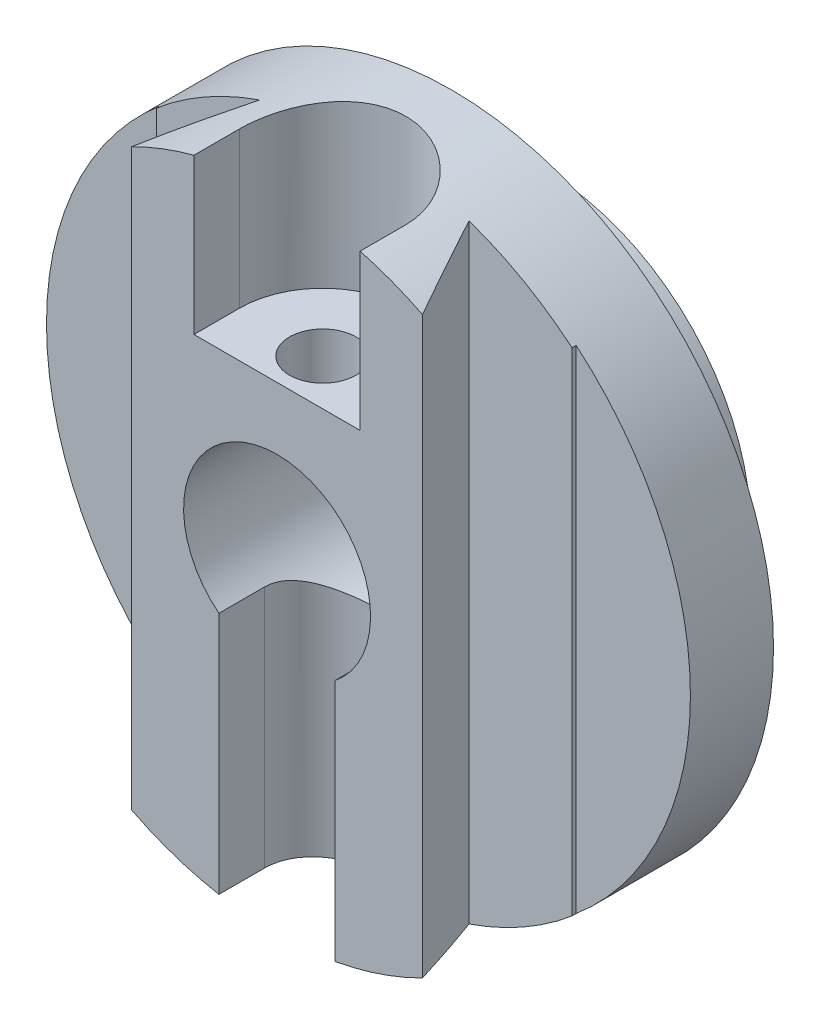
ISO-10303-21;
HEADER;
FILE_DESCRIPTION(('STEP AP214'),'2;1');
FILE_NAME('part.step','',(''),(''),'','','');
FILE_SCHEMA(('AUTOMOTIVE_DESIGN { 1 0 10303 214 1 1 1 1 }'));
ENDSEC;
DATA;
#1=APPLICATION_CONTEXT('core data for automotive mechanical design processes');
#2=APPLICATION_PROTOCOL_DEFINITION('international standard','automotive_design',2000,#1);
#3=PRODUCT_CONTEXT('',#1,'mechanical');
#4=PRODUCT('Part','Part','',(#3));
#5=PRODUCT_RELATED_PRODUCT_CATEGORY('part','',(#4));
#6=PRODUCT_DEFINITION_FORMATION('','',#4);
#7=PRODUCT_DEFINITION_CONTEXT('part definition',#1,'design');
#8=PRODUCT_DEFINITION('design','',#6,#7);
#9=PRODUCT_DEFINITION_SHAPE('','',#8);
#10=(LENGTH_UNIT() NAMED_UNIT(*) SI_UNIT(.MILLI.,.METRE.));
#11=(NAMED_UNIT(*) PLANE_ANGLE_UNIT() SI_UNIT($,.RADIAN.));
#12=(NAMED_UNIT(*) SI_UNIT($,.STERADIAN.) SOLID_ANGLE_UNIT());
#13=UNCERTAINTY_MEASURE_WITH_UNIT(LENGTH_MEASURE(1.E-05),#10,'distance_accuracy_value','');
#14=(GEOMETRIC_REPRESENTATION_CONTEXT(3) GLOBAL_UNCERTAINTY_ASSIGNED_CONTEXT((#13)) GLOBAL_UNIT_ASSIGNED_CONTEXT((#10,
#11,#12)) REPRESENTATION_CONTEXT('',''));
#15=CARTESIAN_POINT('',(0.,0.,0.));
#16=DIRECTION('',(0.,0.,1.));
#17=DIRECTION('',(1.,0.,0.));
#18=AXIS2_PLACEMENT_3D('',#15,#16,#17);
#19=CARTESIAN_POINT('',(0.,0.,0.));
#20=DIRECTION('',(0.,0.,1.));
#21=DIRECTION('',(1.,0.,0.));
#22=AXIS2_PLACEMENT_3D('',#19,#20,#21);
#23=PLANE('',#22);
#24=DIRECTION('',(0.,-1.,0.));
#25=VECTOR('',#24,1.);
#26=CARTESIAN_POINT('',(50.,59.2135964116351,0.));
#27=LINE('',#26,#25);
#28=CARTESIAN_POINT('',(50.,59.2135964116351,0.));
#29=VERTEX_POINT('',#28);
#30=CARTESIAN_POINT('',(50.,-59.2135964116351,0.));
#31=VERTEX_POINT('',#30);
#32=EDGE_CURVE('E429',#29,#31,#27,.T.);
#33=ORIENTED_EDGE('',*,*,#32,.F.);
#34=CARTESIAN_POINT('',(0.,0.,0.));
#35=DIRECTION('',(0.,0.,1.));
#36=DIRECTION('',(1.,0.,0.));
#37=AXIS2_PLACEMENT_3D('',#34,#35,#36);
#38=CIRCLE('',#37,77.5);
#39=CARTESIAN_POINT('',(25.2075391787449,73.2859465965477,0.));
#40=VERTEX_POINT('',#39);
#41=EDGE_CURVE('E263',#29,#40,#38,.T.);
#42=ORIENTED_EDGE('',*,*,#41,.T.);
#43=DIRECTION('',(0.,-1.,0.));
#44=VECTOR('',#43,1.);
#45=CARTESIAN_POINT('',(25.2075391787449,77.501,0.));
#46=LINE('',#45,#44);
#47=CARTESIAN_POINT('',(25.2075391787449,-73.2859465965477,0.));
#48=VERTEX_POINT('',#47);
#49=EDGE_CURVE('E391',#40,#48,#46,.T.);
#50=ORIENTED_EDGE('',*,*,#49,.T.);
#51=EDGE_CURVE('E258',#48,#31,#38,.T.);
#52=ORIENTED_EDGE('',*,*,#51,.T.);
#53=EDGE_LOOP('',(#33,#42,#50,#52));
#54=FACE_BOUND('',#53,.T.);
#55=ADVANCED_FACE('F28',(#54),#23,.T.);
#56=CARTESIAN_POINT('',(50.,0.,-43.));
#57=DIRECTION('',(0.,0.,-1.));
#58=DIRECTION('',(-1.,0.,0.));
#59=AXIS2_PLACEMENT_3D('',#56,#57,#58);
#60=PLANE('',#59);
#61=CARTESIAN_POINT('',(0.,0.,-43.));
#62=DIRECTION('',(0.,0.,1.));
#63=DIRECTION('',(1.,0.,0.));
#64=AXIS2_PLACEMENT_3D('',#61,#62,#63);
#65=CIRCLE('',#64,11.);
#66=CARTESIAN_POINT('',(11.,0.,-43.));
#67=VERTEX_POINT('',#66);
#68=EDGE_CURVE('E153',#67,#67,#65,.T.);
#69=ORIENTED_EDGE('',*,*,#68,.T.);
#70=EDGE_LOOP('',(#69));
#71=FACE_BOUND('',#70,.T.);
#72=CARTESIAN_POINT('',(0.,0.,-43.));
#73=DIRECTION('',(0.,0.,1.));
#74=DIRECTION('',(1.,0.,0.));
#75=AXIS2_PLACEMENT_3D('',#72,#73,#74);
#76=CIRCLE('',#75,50.);
#77=CARTESIAN_POINT('',(50.,0.,-43.));
#78=VERTEX_POINT('',#77);
#79=EDGE_CURVE('E272',#78,#78,#76,.T.);
#80=ORIENTED_EDGE('',*,*,#79,.F.);
#81=EDGE_LOOP('',(#80));
#82=FACE_BOUND('',#81,.T.);
#83=ADVANCED_FACE('F30',(#71,#82),#60,.T.);
#84=CARTESIAN_POINT('',(0.,0.,7.14644545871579));
#85=DIRECTION('',(0.,0.,1.));
#86=DIRECTION('',(1.,0.,0.));
#87=AXIS2_PLACEMENT_3D('',#84,#85,#86);
#88=CYLINDRICAL_SURFACE('',#87,50.);
#89=ORIENTED_EDGE('',*,*,#79,.T.);
#90=EDGE_LOOP('',(#89));
#91=FACE_BOUND('',#90,.T.);
#92=CARTESIAN_POINT('',(0.,0.,-21.));
#93=DIRECTION('',(0.,0.,1.));
#94=DIRECTION('',(1.,0.,0.));
#95=AXIS2_PLACEMENT_3D('',#92,#93,#94);
#96=CIRCLE('',#95,50.);
#97=CARTESIAN_POINT('',(50.,0.,-21.));
#98=VERTEX_POINT('',#97);
#99=EDGE_CURVE('E289',#98,#98,#96,.T.);
#100=ORIENTED_EDGE('',*,*,#99,.F.);
#101=EDGE_LOOP('',(#100));
#102=FACE_BOUND('',#101,.T.);
#103=ADVANCED_FACE('F224',(#91,#102),#88,.T.);
#104=CARTESIAN_POINT('',(77.5,0.,-21.));
#105=DIRECTION('',(0.,0.,-1.));
#106=DIRECTION('',(-1.,0.,0.));
#107=AXIS2_PLACEMENT_3D('',#104,#105,#106);
#108=PLANE('',#107);
#109=ORIENTED_EDGE('',*,*,#99,.T.);
#110=EDGE_LOOP('',(#109));
#111=FACE_BOUND('',#110,.T.);
#112=CARTESIAN_POINT('',(0.,0.,-21.));
#113=DIRECTION('',(0.,0.,1.));
#114=DIRECTION('',(1.,0.,0.));
#115=AXIS2_PLACEMENT_3D('',#112,#113,#114);
#116=CIRCLE('',#115,77.5);
#117=CARTESIAN_POINT('',(77.5,0.,-21.));
#118=VERTEX_POINT('',#117);
#119=EDGE_CURVE('E260',#118,#118,#116,.T.);
#120=ORIENTED_EDGE('',*,*,#119,.F.);
#121=EDGE_LOOP('',(#120));
#122=FACE_BOUND('',#121,.T.);
#123=ADVANCED_FACE('F236',(#111,#122),#108,.T.);
#124=CARTESIAN_POINT('',(0.,0.,7.14644545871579));
#125=DIRECTION('',(0.,0.,1.));
#126=DIRECTION('',(1.,0.,0.));
#127=AXIS2_PLACEMENT_3D('',#124,#125,#126);
#128=CYLINDRICAL_SURFACE('',#127,77.5);
#129=DIRECTION('',(0.,0.,1.));
#130=VECTOR('',#129,1.);
#131=CARTESIAN_POINT('',(-14.,-76.2249959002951,7.14644545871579));
#132=LINE('',#131,#130);
#133=CARTESIAN_POINT('',(-14.,-76.2249959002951,21.));
#134=VERTEX_POINT('',#133);
#135=CARTESIAN_POINT('',(-14.,-76.2249959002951,10.));
#136=VERTEX_POINT('',#135);
#137=EDGE_CURVE('E414',#134,#136,#132,.F.);
#138=ORIENTED_EDGE('',*,*,#137,.F.);
#139=CARTESIAN_POINT('',(0.,0.,21.));
#140=DIRECTION('',(0.,0.,1.));
#141=DIRECTION('',(1.,0.,0.));
#142=AXIS2_PLACEMENT_3D('',#139,#140,#141);
#143=CIRCLE('',#142,77.5);
#144=CARTESIAN_POINT('',(-35.,-69.1465834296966,21.));
#145=VERTEX_POINT('',#144);
#146=EDGE_CURVE('E168',#145,#134,#143,.T.);
#147=ORIENTED_EDGE('',*,*,#146,.F.);
#148=CARTESIAN_POINT('',(0.,0.,-54.0577422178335));
#149=DIRECTION('',(-0.906307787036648,0.,-0.422618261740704));
#150=DIRECTION('',(-0.422618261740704,0.,0.906307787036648));
#151=AXIS2_PLACEMENT_3D('',#148,#149,#150);
#152=ELLIPSE('',#151,183.380622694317,77.5);
#153=CARTESIAN_POINT('',(-25.2075391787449,-73.2859465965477,0.));
#154=VERTEX_POINT('',#153);
#155=EDGE_CURVE('E257',#154,#145,#152,.T.);
#156=ORIENTED_EDGE('',*,*,#155,.F.);
#157=CARTESIAN_POINT('',(-50.,-59.2135964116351,0.));
#158=VERTEX_POINT('',#157);
#159=EDGE_CURVE('E242',#158,#154,#38,.T.);
#160=ORIENTED_EDGE('',*,*,#159,.F.);
#161=DIRECTION('',(0.,0.,1.));
#162=VECTOR('',#161,1.);
#163=CARTESIAN_POINT('',(-50.,-59.2135964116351,-1.));
#164=LINE('',#163,#162);
#165=CARTESIAN_POINT('',(-50.,-59.2135964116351,-1.));
#166=VERTEX_POINT('',#165);
#167=EDGE_CURVE('E255',#166,#158,#164,.T.);
#168=ORIENTED_EDGE('',*,*,#167,.F.);
#169=CARTESIAN_POINT('',(0.,0.,-1.));
#170=DIRECTION('',(0.,0.,1.));
#171=DIRECTION('',(1.,0.,0.));
#172=AXIS2_PLACEMENT_3D('',#169,#170,#171);
#173=CIRCLE('',#172,77.5);
#174=CARTESIAN_POINT('',(-50.,59.2135964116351,-1.));
#175=VERTEX_POINT('',#174);
#176=EDGE_CURVE('E248',#175,#166,#173,.T.);
#177=ORIENTED_EDGE('',*,*,#176,.F.);
#178=DIRECTION('',(0.,0.,1.));
#179=VECTOR('',#178,1.);
#180=CARTESIAN_POINT('',(-50.,59.2135964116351,-1.));
#181=LINE('',#180,#179);
#182=CARTESIAN_POINT('',(-50.,59.2135964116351,0.));
#183=VERTEX_POINT('',#182);
#184=EDGE_CURVE('E383',#175,#183,#181,.T.);
#185=ORIENTED_EDGE('',*,*,#184,.T.);
#186=CARTESIAN_POINT('',(-25.2075391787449,73.2859465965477,0.));
#187=VERTEX_POINT('',#186);
#188=EDGE_CURVE('E245',#187,#183,#38,.T.);
#189=ORIENTED_EDGE('',*,*,#188,.F.);
#190=CARTESIAN_POINT('',(0.,0.,-54.0577422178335));
#191=DIRECTION('',(0.906307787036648,0.,0.422618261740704));
#192=DIRECTION('',(-0.422618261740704,0.,0.906307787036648));
#193=AXIS2_PLACEMENT_3D('',#190,#191,#192);
#194=ELLIPSE('',#193,183.380622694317,77.5);
#195=CARTESIAN_POINT('',(-35.,69.1465834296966,21.));
#196=VERTEX_POINT('',#195);
#197=EDGE_CURVE('E400',#187,#196,#194,.T.);
#198=ORIENTED_EDGE('',*,*,#197,.T.);
#199=CARTESIAN_POINT('',(0.,0.,21.));
#200=DIRECTION('',(0.,0.,-1.));
#201=DIRECTION('',(-1.,0.,0.));
#202=AXIS2_PLACEMENT_3D('',#199,#200,#201);
#203=CIRCLE('',#202,77.5);
#204=CARTESIAN_POINT('',(-20.,74.8748956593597,21.));
#205=VERTEX_POINT('',#204);
#206=EDGE_CURVE('E398',#196,#205,#203,.T.);
#207=ORIENTED_EDGE('',*,*,#206,.T.);
#208=DIRECTION('',(0.,0.,1.));
#209=VECTOR('',#208,1.);
#210=CARTESIAN_POINT('',(-20.,74.8748956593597,7.14644545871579));
#211=LINE('',#210,#209);
#212=CARTESIAN_POINT('',(-20.,74.8748956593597,10.));
#213=VERTEX_POINT('',#212);
#214=EDGE_CURVE('E431',#213,#205,#211,.T.);
#215=ORIENTED_EDGE('',*,*,#214,.F.);
#216=CARTESIAN_POINT('',(20.,74.8748956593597,10.));
#217=CARTESIAN_POINT('',(20.0000009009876,74.8748931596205,9.72374682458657));
#218=CARTESIAN_POINT('',(19.9942755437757,74.8764250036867,9.44752556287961));
#219=CARTESIAN_POINT('',(19.971394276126,74.8825321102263,8.89559911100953));
#220=CARTESIAN_POINT('',(19.954238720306,74.8871072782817,8.61989390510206));
#221=CARTESIAN_POINT('',(19.8856770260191,74.905355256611,7.79442002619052));
#222=CARTESIAN_POINT('',(19.8171758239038,74.9235505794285,7.24607654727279));
#223=CARTESIAN_POINT('',(19.6353414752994,74.9714089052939,6.15855538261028));
#224=CARTESIAN_POINT('',(19.5221008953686,75.0010482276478,5.61936115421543));
#225=CARTESIAN_POINT('',(19.3193923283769,75.0534200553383,4.81957672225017));
#226=CARTESIAN_POINT('',(19.2463430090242,75.0721974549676,4.55446797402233));
#227=CARTESIAN_POINT('',(19.0894196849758,75.1122534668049,4.02759444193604));
#228=CARTESIAN_POINT('',(19.0055430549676,75.1335326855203,3.76583048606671));
#229=CARTESIAN_POINT('',(18.7379988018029,75.2008732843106,2.98651770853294));
#230=CARTESIAN_POINT('',(18.5383456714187,75.2504562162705,2.47466762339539));
#231=CARTESIAN_POINT('',(18.0979783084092,75.3575773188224,1.46981104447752));
#232=CARTESIAN_POINT('',(17.8572630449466,75.4151156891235,0.976805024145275));
#233=CARTESIAN_POINT('',(17.4667420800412,75.506163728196,0.253818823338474));
#234=CARTESIAN_POINT('',(17.3316160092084,75.5373130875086,0.0155090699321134));
#235=CARTESIAN_POINT('',(17.0518157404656,75.60096671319,-0.455167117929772));
#236=CARTESIAN_POINT('',(16.9071439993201,75.6334706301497,-0.687535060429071));
#237=CARTESIAN_POINT('',(16.4590905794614,75.7327006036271,-1.3753101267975));
#238=CARTESIAN_POINT('',(16.14165249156,75.8011491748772,-1.82142218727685));
#239=CARTESIAN_POINT('',(15.4645151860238,75.9422204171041,-2.69490503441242));
#240=CARTESIAN_POINT('',(15.1040682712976,76.0149005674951,-3.12168525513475));
#241=CARTESIAN_POINT('',(14.3488180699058,76.1610748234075,-3.94355973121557));
#242=CARTESIAN_POINT('',(13.9540142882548,76.2345689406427,-4.33865352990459));
#243=CARTESIAN_POINT('',(13.1325709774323,76.3803611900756,-5.09460824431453));
#244=CARTESIAN_POINT('',(12.7059264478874,76.452659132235,-5.45546376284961));
#245=CARTESIAN_POINT('',(11.8236088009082,76.5940719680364,-6.14045212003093));
#246=CARTESIAN_POINT('',(11.3679355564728,76.6631868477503,-6.46458479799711));
#247=CARTESIAN_POINT('',(10.4234962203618,76.7973408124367,-7.07842595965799));
#248=CARTESIAN_POINT('',(9.93433692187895,76.8623034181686,-7.36754664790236));
#249=CARTESIAN_POINT('',(8.93248470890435,76.9851633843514,-7.90344768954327));
#250=CARTESIAN_POINT('',(8.41979148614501,77.0430606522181,-8.15022748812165));
#251=CARTESIAN_POINT('',(7.37454957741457,77.1501259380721,-8.59944993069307));
#252=CARTESIAN_POINT('',(6.84200428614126,77.1992954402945,-8.80190011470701));
#253=CARTESIAN_POINT('',(5.76082393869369,77.2874959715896,-9.16082793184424));
#254=CARTESIAN_POINT('',(5.21218928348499,77.32652725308,-9.31730670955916));
#255=CARTESIAN_POINT('',(4.11484145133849,77.3925945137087,-9.58007942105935));
#256=CARTESIAN_POINT('',(3.5663837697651,77.4198704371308,-9.68738036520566));
#257=CARTESIAN_POINT('',(2.46196707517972,77.4628561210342,-9.85574781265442));
#258=CARTESIAN_POINT('',(1.90600815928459,77.4785660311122,-9.91681491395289));
#259=CARTESIAN_POINT('',(0.790783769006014,77.4979719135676,-9.99217296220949));
#260=CARTESIAN_POINT('',(0.231518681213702,77.5016692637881,-10.0064692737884));
#261=CARTESIAN_POINT('',(-0.88618860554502,77.4969481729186,-9.98817295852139));
#262=CARTESIAN_POINT('',(-1.44463081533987,77.4885298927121,-9.95558095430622));
#263=CARTESIAN_POINT('',(-2.54334334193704,77.4601591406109,-9.84512552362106));
#264=CARTESIAN_POINT('',(-3.08373085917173,77.4404844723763,-9.76835221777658));
#265=CARTESIAN_POINT('',(-4.1559327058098,77.3903498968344,-9.57103353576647));
#266=CARTESIAN_POINT('',(-4.6877471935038,77.3598901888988,-9.45048896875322));
#267=CARTESIAN_POINT('',(-5.73915279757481,77.2890016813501,-9.16660253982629));
#268=CARTESIAN_POINT('',(-6.25874361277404,77.2485726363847,-9.00325962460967));
#269=CARTESIAN_POINT('',(-7.28220520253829,77.1588193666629,-8.63505469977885));
#270=CARTESIAN_POINT('',(-7.78607574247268,77.1094950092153,-8.43019207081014));
#271=CARTESIAN_POINT('',(-8.77948961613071,77.0027435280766,-7.97835185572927));
#272=CARTESIAN_POINT('',(-9.26885208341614,76.9452440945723,-7.73099381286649));
#273=CARTESIAN_POINT('',(-10.2250429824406,76.8240247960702,-7.1973335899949));
#274=CARTESIAN_POINT('',(-10.6918713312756,76.7603049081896,-6.9110312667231));
#275=CARTESIAN_POINT('',(-11.6001141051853,76.6283106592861,-6.301427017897));
#276=CARTESIAN_POINT('',(-12.0415251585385,76.5600356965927,-5.97812020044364));
#277=CARTESIAN_POINT('',(-12.8961303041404,76.4207256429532,-5.29668339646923));
#278=CARTESIAN_POINT('',(-13.3093238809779,76.3496905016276,-4.93855277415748));
#279=CARTESIAN_POINT('',(-14.1163696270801,76.2046652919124,-4.17899485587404));
#280=CARTESIAN_POINT('',(-14.5093255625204,76.1306489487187,-3.77661951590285));
#281=CARTESIAN_POINT('',(-15.2600590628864,75.9837282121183,-2.9401119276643));
#282=CARTESIAN_POINT('',(-15.6178357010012,75.9108238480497,-2.50597884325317));
#283=CARTESIAN_POINT('',(-16.2959182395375,75.7681539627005,-1.60858748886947));
#284=CARTESIAN_POINT('',(-16.6162131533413,75.6983893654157,-1.14532074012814));
#285=CARTESIAN_POINT('',(-17.0666380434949,75.5976423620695,-0.431162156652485));
#286=CARTESIAN_POINT('',(-17.2117803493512,75.5647091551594,-0.1898926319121));
#287=CARTESIAN_POINT('',(-17.4918740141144,75.500364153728,0.29877969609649));
#288=CARTESIAN_POINT('',(-17.626822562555,75.4689527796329,0.546184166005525));
#289=CARTESIAN_POINT('',(-18.0174429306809,75.3770103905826,1.29982143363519));
#290=CARTESIAN_POINT('',(-18.2571733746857,75.3191589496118,1.81475896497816));
#291=CARTESIAN_POINT('',(-18.6922268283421,75.2123720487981,2.86395438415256));
#292=CARTESIAN_POINT('',(-18.8875511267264,75.1634363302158,3.39821171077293));
#293=CARTESIAN_POINT('',(-19.1459044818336,75.0978837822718,4.21077891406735));
#294=CARTESIAN_POINT('',(-19.2262228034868,75.0773486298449,4.48337778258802));
#295=CARTESIAN_POINT('',(-19.375198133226,75.0390405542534,5.0318569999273));
#296=CARTESIAN_POINT('',(-19.4438580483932,75.0212669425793,5.30773651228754));
#297=CARTESIAN_POINT('',(-19.632090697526,74.9723149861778,6.1394443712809));
#298=CARTESIAN_POINT('',(-19.7340166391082,74.9454798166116,6.699657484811));
#299=CARTESIAN_POINT('',(-19.8745195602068,74.9083291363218,7.7167776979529));
#300=CARTESIAN_POINT('',(-19.9215862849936,74.8958095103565,8.17246639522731));
#301=CARTESIAN_POINT('',(-19.9843128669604,74.8790856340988,9.08541531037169));
#302=CARTESIAN_POINT('',(-20.0000230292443,74.8748680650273,9.54267183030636));
#303=CARTESIAN_POINT('',(-20.,74.8748956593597,10.));
#304=B_SPLINE_CURVE_WITH_KNOTS('',3,(#216,#217,#218,#219,#220,#221,#222,#223,#224,#225,#226,
#227,#228,#229,#230,#231,#232,#233,#234,#235,#236,#237,#238,#239,#240,#241,#242,#243,#244,#245,
#246,#247,#248,#249,#250,#251,#252,#253,#254,#255,#256,#257,#258,#259,#260,#261,#262,#263,#264,
#265,#266,#267,#268,#269,#270,#271,#272,#273,#274,#275,#276,#277,#278,#279,#280,#281,#282,#283,
#284,#285,#286,#287,#288,#289,#290,#291,#292,#293,#294,#295,#296,#297,#298,#299,#300,#301,#302,
#303),.UNSPECIFIED.,.F.,.F.,(4,2,2,2,2,2,2,2,2,2,2,2,2,2,2,2,2,2,2,2,2,2,2,2,2,2,2,2,2,2,2,2,2,
2,2,2,2,2,2,2,2,2,2,4),(0.,0.828632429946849,1.65723915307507,3.31380514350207,4.96696146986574,
5.79363536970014,6.62051009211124,8.27339282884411,9.9263170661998,10.7532693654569,
11.5800096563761,13.2333749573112,14.9214725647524,16.6095944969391,18.297982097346,
19.9863770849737,21.7000407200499,23.4137268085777,25.1271211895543,26.8404729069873,
28.5169730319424,30.1934514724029,31.8697376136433,33.5460014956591,35.1825779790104,
36.8191242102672,38.4557107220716,40.0923216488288,41.7444312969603,43.3965470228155,
45.0488814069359,46.7012459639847,48.4010637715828,50.1009263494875,51.8012859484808,
52.65151265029,53.5019729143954,55.2125774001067,56.9231322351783,57.777670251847,
58.6319948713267,60.3396514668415,61.7134133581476,63.0849695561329),.UNSPECIFIED.);
#305=CARTESIAN_POINT('',(20.,74.8748956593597,10.));
#306=VERTEX_POINT('',#305);
#307=EDGE_CURVE('E172',#306,#213,#304,.T.);
#308=ORIENTED_EDGE('',*,*,#307,.F.);
#309=DIRECTION('',(0.,0.,1.));
#310=VECTOR('',#309,1.);
#311=CARTESIAN_POINT('',(20.,74.8748956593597,7.14644545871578));
#312=LINE('',#311,#310);
#313=CARTESIAN_POINT('',(20.,74.8748956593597,21.));
#314=VERTEX_POINT('',#313);
#315=EDGE_CURVE('E433',#314,#306,#312,.F.);
#316=ORIENTED_EDGE('',*,*,#315,.F.);
#317=CARTESIAN_POINT('',(35.,69.1465834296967,21.));
#318=VERTEX_POINT('',#317);
#319=EDGE_CURVE('E404',#314,#318,#203,.T.);
#320=ORIENTED_EDGE('',*,*,#319,.T.);
#321=CARTESIAN_POINT('',(0.,0.,-54.0577422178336));
#322=DIRECTION('',(-0.906307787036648,0.,0.422618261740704));
#323=DIRECTION('',(0.422618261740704,0.,0.906307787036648));
#324=AXIS2_PLACEMENT_3D('',#321,#322,#323);
#325=ELLIPSE('',#324,183.380622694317,77.5);
#326=EDGE_CURVE('E390',#318,#40,#325,.T.);
#327=ORIENTED_EDGE('',*,*,#326,.T.);
#328=ORIENTED_EDGE('',*,*,#41,.F.);
#329=DIRECTION('',(0.,0.,1.));
#330=VECTOR('',#329,1.);
#331=CARTESIAN_POINT('',(50.,59.2135964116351,-1.));
#332=LINE('',#331,#330);
#333=CARTESIAN_POINT('',(50.,59.2135964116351,-1.));
#334=VERTEX_POINT('',#333);
#335=EDGE_CURVE('E422',#334,#29,#332,.T.);
#336=ORIENTED_EDGE('',*,*,#335,.F.);
#337=CARTESIAN_POINT('',(0.,0.,-1.));
#338=DIRECTION('',(0.,0.,1.));
#339=DIRECTION('',(-1.,0.,0.));
#340=AXIS2_PLACEMENT_3D('',#337,#338,#339);
#341=CIRCLE('',#340,77.5);
#342=CARTESIAN_POINT('',(50.,-59.2135964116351,-1.));
#343=VERTEX_POINT('',#342);
#344=EDGE_CURVE('E427',#343,#334,#341,.T.);
#345=ORIENTED_EDGE('',*,*,#344,.F.);
#346=DIRECTION('',(0.,0.,1.));
#347=VECTOR('',#346,1.);
#348=CARTESIAN_POINT('',(50.,-59.2135964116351,-1.));
#349=LINE('',#348,#347);
#350=EDGE_CURVE('E249',#343,#31,#349,.T.);
#351=ORIENTED_EDGE('',*,*,#350,.T.);
#352=ORIENTED_EDGE('',*,*,#51,.F.);
#353=CARTESIAN_POINT('',(0.,0.,-54.0577422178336));
#354=DIRECTION('',(0.906307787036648,0.,-0.422618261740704));
#355=DIRECTION('',(0.422618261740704,0.,0.906307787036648));
#356=AXIS2_PLACEMENT_3D('',#353,#354,#355);
#357=ELLIPSE('',#356,183.380622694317,77.5);
#358=CARTESIAN_POINT('',(35.,-69.1465834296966,21.));
#359=VERTEX_POINT('',#358);
#360=EDGE_CURVE('E388',#359,#48,#357,.T.);
#361=ORIENTED_EDGE('',*,*,#360,.F.);
#362=CARTESIAN_POINT('',(14.,-76.2249959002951,21.));
#363=VERTEX_POINT('',#362);
#364=EDGE_CURVE('E378',#363,#359,#143,.T.);
#365=ORIENTED_EDGE('',*,*,#364,.F.);
#366=DIRECTION('',(0.,0.,1.));
#367=VECTOR('',#366,1.);
#368=CARTESIAN_POINT('',(14.,-76.2249959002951,7.14644545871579));
#369=LINE('',#368,#367);
#370=CARTESIAN_POINT('',(14.,-76.2249959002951,10.));
#371=VERTEX_POINT('',#370);
#372=EDGE_CURVE('E375',#371,#363,#369,.T.);
#373=ORIENTED_EDGE('',*,*,#372,.F.);
#374=CARTESIAN_POINT('',(-8.66025403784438,-77.0146090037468,21.));
#375=CARTESIAN_POINT('',(-8.96994989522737,-76.9797897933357,20.756224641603));
#376=CARTESIAN_POINT('',(-9.26924845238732,-76.9442359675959,20.499360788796));
#377=CARTESIAN_POINT('',(-9.84510711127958,-76.872672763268,19.9613677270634));
#378=CARTESIAN_POINT('',(-10.1216677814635,-76.8366633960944,19.6802391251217));
#379=CARTESIAN_POINT('',(-10.6500894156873,-76.7652054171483,19.0956524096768));
#380=CARTESIAN_POINT('',(-10.9019534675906,-76.7297567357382,18.7921970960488));
#381=CARTESIAN_POINT('',(-11.3792687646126,-76.6604226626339,18.1650177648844));
#382=CARTESIAN_POINT('',(-11.6047204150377,-76.6265372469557,17.8412940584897));
#383=CARTESIAN_POINT('',(-12.0277499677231,-76.5612767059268,17.1755745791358));
#384=CARTESIAN_POINT('',(-12.2253094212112,-76.5299032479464,16.8335669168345));
#385=CARTESIAN_POINT('',(-12.5909369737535,-76.4705997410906,16.1338505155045));
#386=CARTESIAN_POINT('',(-12.7590054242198,-76.4426696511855,15.7761419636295));
#387=CARTESIAN_POINT('',(-13.0643373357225,-76.3910797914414,15.0476729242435));
#388=CARTESIAN_POINT('',(-13.2016126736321,-76.3674183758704,14.6769175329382));
#389=CARTESIAN_POINT('',(-13.4443862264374,-76.3250527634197,13.9248696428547));
#390=CARTESIAN_POINT('',(-13.5498848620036,-76.3063485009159,13.5435772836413));
#391=CARTESIAN_POINT('',(-13.7275182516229,-76.2745915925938,12.7764931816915));
#392=CARTESIAN_POINT('',(-13.7999293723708,-76.2614921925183,12.3907673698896));
#393=CARTESIAN_POINT('',(-13.9121304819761,-76.2411036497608,11.6144465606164));
#394=CARTESIAN_POINT('',(-13.9519205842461,-76.2338144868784,11.2238515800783));
#395=CARTESIAN_POINT('',(-13.9985648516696,-76.2252631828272,10.4405894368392));
#396=CARTESIAN_POINT('',(-14.005415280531,-76.2240017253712,10.0479220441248));
#397=CARTESIAN_POINT('',(-13.9861149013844,-76.2275454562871,9.26342849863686));
#398=CARTESIAN_POINT('',(-13.9599643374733,-76.2323505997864,8.87160233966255));
#399=CARTESIAN_POINT('',(-13.8753936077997,-76.2477885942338,8.09642289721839));
#400=CARTESIAN_POINT('',(-13.8173721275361,-76.2583494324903,7.71302460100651));
#401=CARTESIAN_POINT('',(-13.6697860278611,-76.2849432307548,6.95254604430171));
#402=CARTESIAN_POINT('',(-13.5802217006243,-76.3009761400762,6.57546572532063));
#403=CARTESIAN_POINT('',(-13.3702355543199,-76.3380518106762,5.83026974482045));
#404=CARTESIAN_POINT('',(-13.2498149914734,-76.3590943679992,5.46215371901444));
#405=CARTESIAN_POINT('',(-12.979010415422,-76.4055897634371,4.73740150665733));
#406=CARTESIAN_POINT('',(-12.828626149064,-76.4310426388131,4.3807654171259));
#407=CARTESIAN_POINT('',(-12.4980579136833,-76.4857944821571,3.6794239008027));
#408=CARTESIAN_POINT('',(-12.3177110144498,-76.5151142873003,3.33479690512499));
#409=CARTESIAN_POINT('',(-11.9291100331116,-76.5766610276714,2.66192958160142));
#410=CARTESIAN_POINT('',(-11.7208558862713,-76.6088879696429,2.33368929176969));
#411=CARTESIAN_POINT('',(-11.2778711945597,-76.6753530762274,1.69575803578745));
#412=CARTESIAN_POINT('',(-11.0431379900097,-76.7095914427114,1.38606893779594));
#413=CARTESIAN_POINT('',(-10.5488153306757,-76.7791298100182,0.787334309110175));
#414=CARTESIAN_POINT('',(-10.2892256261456,-76.8144298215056,0.49828898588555));
#415=CARTESIAN_POINT('',(-9.74297169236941,-76.8856387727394,-0.0612924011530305));
#416=CARTESIAN_POINT('',(-9.45596734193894,-76.9215490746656,-0.331496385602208));
#417=CARTESIAN_POINT('',(-8.86013583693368,-76.9924540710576,-0.846802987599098));
#418=CARTESIAN_POINT('',(-8.55130845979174,-77.0274487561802,-1.09190534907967));
#419=CARTESIAN_POINT('',(-7.9139442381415,-77.095539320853,-1.55528992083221));
#420=CARTESIAN_POINT('',(-7.58540723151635,-77.1286351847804,-1.7735719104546));
#421=CARTESIAN_POINT('',(-6.91088792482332,-77.1919967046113,-2.18174955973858));
#422=CARTESIAN_POINT('',(-6.56490569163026,-77.2222623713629,-2.37164532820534));
#423=CARTESIAN_POINT('',(-5.85751086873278,-77.2791407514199,-2.72185117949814));
#424=CARTESIAN_POINT('',(-5.49608177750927,-77.3057494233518,-2.88212859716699));
#425=CARTESIAN_POINT('',(-4.760699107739,-77.3545184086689,-3.17163208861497));
#426=CARTESIAN_POINT('',(-4.38674549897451,-77.3766787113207,-3.30085808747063));
#427=CARTESIAN_POINT('',(-3.62902561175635,-77.4159161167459,-3.52725055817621));
#428=CARTESIAN_POINT('',(-3.24526011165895,-77.4329936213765,-3.62441956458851));
#429=CARTESIAN_POINT('',(-2.47068126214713,-77.4615770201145,-3.78594369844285));
#430=CARTESIAN_POINT('',(-2.07986800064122,-77.4730829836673,-3.85029923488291));
#431=CARTESIAN_POINT('',(-1.29947459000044,-77.4900741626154,-3.94502542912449));
#432=CARTESIAN_POINT('',(-0.909951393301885,-77.4956399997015,-3.97585127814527));
#433=CARTESIAN_POINT('',(-0.129653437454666,-77.5008735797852,-4.00484245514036));
#434=CARTESIAN_POINT('',(0.261121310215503,-77.5005413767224,-4.00300808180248));
#435=CARTESIAN_POINT('',(1.0410834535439,-77.4939884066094,-3.9666945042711));
#436=CARTESIAN_POINT('',(1.4302709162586,-77.4877678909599,-3.93221669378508));
#437=CARTESIAN_POINT('',(2.20427246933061,-77.4696136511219,-3.83089001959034));
#438=CARTESIAN_POINT('',(2.58908656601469,-77.4576799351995,-3.76404120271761));
#439=CARTESIAN_POINT('',(3.34884372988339,-77.4285395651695,-3.59909077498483));
#440=CARTESIAN_POINT('',(3.72383791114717,-77.4113714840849,-3.50121758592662));
#441=CARTESIAN_POINT('',(4.46419225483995,-77.3722069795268,-3.27481949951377));
#442=CARTESIAN_POINT('',(4.82955247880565,-77.3502105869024,-3.14629479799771));
#443=CARTESIAN_POINT('',(5.54815008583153,-77.3019904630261,-2.85953703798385));
#444=CARTESIAN_POINT('',(5.9013868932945,-77.2757665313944,-2.70130257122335));
#445=CARTESIAN_POINT('',(6.5933332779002,-77.2198061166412,-2.35627049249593));
#446=CARTESIAN_POINT('',(6.93204270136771,-77.1900695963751,-2.16947257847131));
#447=CARTESIAN_POINT('',(7.59605469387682,-77.1275716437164,-1.76657558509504));
#448=CARTESIAN_POINT('',(7.92118455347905,-77.0947823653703,-1.55019616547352));
#449=CARTESIAN_POINT('',(8.55211552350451,-77.027345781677,-1.09114621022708));
#450=CARTESIAN_POINT('',(8.8579165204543,-76.9926984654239,-0.848475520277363));
#451=CARTESIAN_POINT('',(9.44815971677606,-76.9224975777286,-0.338491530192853));
#452=CARTESIAN_POINT('',(9.73260021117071,-76.8869439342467,-0.0711762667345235));
#453=CARTESIAN_POINT('',(10.2781822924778,-76.8159141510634,0.48626923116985));
#454=CARTESIAN_POINT('',(10.5393237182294,-76.7804380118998,0.776399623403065));
#455=CARTESIAN_POINT('',(11.0395901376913,-76.7101170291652,1.38122106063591));
#456=CARTESIAN_POINT('',(11.2784052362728,-76.6752852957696,1.69617005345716));
#457=CARTESIAN_POINT('',(11.7286544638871,-76.6077052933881,2.34528352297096));
#458=CARTESIAN_POINT('',(11.940088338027,-76.5749570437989,2.67944817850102));
#459=CARTESIAN_POINT('',(12.3340393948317,-76.5124909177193,3.36466694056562));
#460=CARTESIAN_POINT('',(12.5165575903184,-76.4827729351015,3.71572045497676));
#461=CARTESIAN_POINT('',(12.8513325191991,-76.4272337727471,4.43226910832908));
#462=CARTESIAN_POINT('',(13.0035895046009,-76.4014125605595,4.79776412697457));
#463=CARTESIAN_POINT('',(13.2760468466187,-76.3545389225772,5.53886603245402));
#464=CARTESIAN_POINT('',(13.3963936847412,-76.3334647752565,5.91441768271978));
#465=CARTESIAN_POINT('',(13.6050322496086,-76.2965551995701,6.67457715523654));
#466=CARTESIAN_POINT('',(13.6933240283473,-76.2807197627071,7.05918496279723));
#467=CARTESIAN_POINT('',(13.8371504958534,-76.254761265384,7.83464499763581));
#468=CARTESIAN_POINT('',(13.8926871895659,-76.2446378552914,8.22549684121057));
#469=CARTESIAN_POINT('',(13.970565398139,-76.2304065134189,9.01060098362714));
#470=CARTESIAN_POINT('',(13.9929073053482,-76.2262985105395,9.40485324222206));
#471=CARTESIAN_POINT('',(14.004133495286,-76.2242367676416,10.1880349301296));
#472=CARTESIAN_POINT('',(13.9935058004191,-76.2261932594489,10.5769572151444));
#473=CARTESIAN_POINT('',(13.9399369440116,-76.2360078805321,11.3524925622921));
#474=CARTESIAN_POINT('',(13.8969960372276,-76.2438659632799,11.7391056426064));
#475=CARTESIAN_POINT('',(13.779138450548,-76.2652536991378,12.5072551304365));
#476=CARTESIAN_POINT('',(13.7042225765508,-76.2787832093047,12.8887916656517));
#477=CARTESIAN_POINT('',(13.5229941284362,-76.3111203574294,13.6440997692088));
#478=CARTESIAN_POINT('',(13.4166817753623,-76.3299279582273,14.0178713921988));
#479=CARTESIAN_POINT('',(13.1736472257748,-76.3722475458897,14.7544945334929));
#480=CARTESIAN_POINT('',(13.0369706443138,-76.3957524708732,15.117361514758));
#481=CARTESIAN_POINT('',(12.7341197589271,-76.4468165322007,15.8302820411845));
#482=CARTESIAN_POINT('',(12.5679447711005,-76.4743757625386,16.180335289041));
#483=CARTESIAN_POINT('',(12.2073160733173,-76.5327693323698,16.8652175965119));
#484=CARTESIAN_POINT('',(12.0128651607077,-76.5636033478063,17.2000481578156));
#485=CARTESIAN_POINT('',(11.5970461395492,-76.6276891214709,17.8522635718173));
#486=CARTESIAN_POINT('',(11.3756822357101,-76.6609405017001,18.1696511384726));
#487=CARTESIAN_POINT('',(10.9624441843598,-76.7209723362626,18.71277430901));
#488=CARTESIAN_POINT('',(10.7758150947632,-76.7474432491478,18.9425586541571));
#489=CARTESIAN_POINT('',(10.3884084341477,-76.8008411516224,19.3898073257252));
#490=CARTESIAN_POINT('',(10.1876318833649,-76.8277681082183,19.6072725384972));
#491=CARTESIAN_POINT('',(9.77298266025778,-76.8816130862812,20.028762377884));
#492=CARTESIAN_POINT('',(9.55912764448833,-76.9085310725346,20.2328043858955));
#493=CARTESIAN_POINT('',(9.11887958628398,-76.9619730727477,20.6270145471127));
#494=CARTESIAN_POINT('',(8.89248443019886,-76.9884970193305,20.817180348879));
#495=CARTESIAN_POINT('',(8.66025403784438,-77.0146090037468,21.));
#496=B_SPLINE_CURVE_WITH_KNOTS('',3,(#374,#375,#376,#377,#378,#379,#380,#381,#382,#383,#384,
#385,#386,#387,#388,#389,#390,#391,#392,#393,#394,#395,#396,#397,#398,#399,#400,#401,#402,#403,
#404,#405,#406,#407,#408,#409,#410,#411,#412,#413,#414,#415,#416,#417,#418,#419,#420,#421,#422,
#423,#424,#425,#426,#427,#428,#429,#430,#431,#432,#433,#434,#435,#436,#437,#438,#439,#440,#441,
#442,#443,#444,#445,#446,#447,#448,#449,#450,#451,#452,#453,#454,#455,#456,#457,#458,#459,#460,
#461,#462,#463,#464,#465,#466,#467,#468,#469,#470,#471,#472,#473,#474,#475,#476,#477,#478,#479,
#480,#481,#482,#483,#484,#485,#486,#487,#488,#489,#490,#491,#492,#493,#494,#495),.UNSPECIFIED.,
.F.,.F.,(4,2,2,2,2,2,2,2,2,2,2,2,2,2,2,2,2,2,2,2,2,2,2,2,2,2,2,2,2,2,2,2,2,2,2,2,2,2,2,2,2,2,2,
2,2,2,2,2,2,2,2,2,2,2,2,2,2,2,2,2,4),(0.,1.18663048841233,2.3732313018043,3.55968356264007,
4.74611761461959,5.93333277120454,7.12053378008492,8.30727609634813,9.49400270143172,
10.6706272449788,11.8472476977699,13.024001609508,14.2007468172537,15.3630962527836,
16.525434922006,17.6877262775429,18.8500274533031,20.0188692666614,21.18771379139,
22.3566758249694,23.5256496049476,24.7117004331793,25.8977633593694,27.0838360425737,
28.2699041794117,29.457272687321,30.644644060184,31.8319215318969,33.0191842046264,
34.1901195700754,35.3610442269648,36.531918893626,37.7027918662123,38.8652368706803,
40.0276744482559,41.1901671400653,42.3526721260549,43.5270758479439,44.7014864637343,
45.8759907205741,47.0505031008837,48.2394448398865,49.428397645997,50.6173087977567,
51.8062100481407,52.9895553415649,54.1728987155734,55.3561696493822,56.5394265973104,
57.705252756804,58.8710697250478,60.0368573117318,61.2026366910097,62.36667646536,
63.5307432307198,64.6946949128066,65.8584649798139,66.7495260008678,67.6405228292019,
68.5303422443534,69.420312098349),.UNSPECIFIED.);
#497=EDGE_CURVE('E41',#136,#371,#496,.T.);
#498=ORIENTED_EDGE('',*,*,#497,.F.);
#499=EDGE_LOOP('',(#138,#147,#156,#160,#168,#177,#185,#189,#198,#207,#215,#308,#316,#320,#327,
#328,#336,#345,#351,#352,#361,#365,#373,#498));
#500=FACE_BOUND('',#499,.T.);
#501=ORIENTED_EDGE('',*,*,#119,.T.);
#502=EDGE_LOOP('',(#501));
#503=FACE_BOUND('',#502,.T.);
#504=ADVANCED_FACE('F180',(#500,#503),#128,.T.);
#505=DIRECTION('',(0.,1.,0.));
#506=VECTOR('',#505,1.);
#507=CARTESIAN_POINT('',(-50.,59.2135964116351,0.));
#508=LINE('',#507,#506);
#509=EDGE_CURVE('E240',#158,#183,#508,.T.);
#510=ORIENTED_EDGE('',*,*,#509,.F.);
#511=ORIENTED_EDGE('',*,*,#159,.T.);
#512=DIRECTION('',(0.,-1.,0.));
#513=VECTOR('',#512,1.);
#514=CARTESIAN_POINT('',(-25.2075391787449,77.501,0.));
#515=LINE('',#514,#513);
#516=EDGE_CURVE('E278',#187,#154,#515,.T.);
#517=ORIENTED_EDGE('',*,*,#516,.F.);
#518=ORIENTED_EDGE('',*,*,#188,.T.);
#519=EDGE_LOOP('',(#510,#511,#517,#518));
#520=FACE_BOUND('',#519,.T.);
#521=ADVANCED_FACE('F218',(#520),#23,.T.);
#522=CARTESIAN_POINT('',(-25.2075391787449,77.501,0.));
#523=DIRECTION('',(0.906307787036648,0.,0.422618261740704));
#524=DIRECTION('',(0.422618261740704,0.,-0.906307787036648));
#525=AXIS2_PLACEMENT_3D('',#522,#523,#524);
#526=PLANE('',#525);
#527=ORIENTED_EDGE('',*,*,#197,.F.);
#528=ORIENTED_EDGE('',*,*,#516,.T.);
#529=ORIENTED_EDGE('',*,*,#155,.T.);
#530=DIRECTION('',(0.,-1.,0.));
#531=VECTOR('',#530,1.);
#532=CARTESIAN_POINT('',(-35.,77.501,21.));
#533=LINE('',#532,#531);
#534=EDGE_CURVE('E281',#196,#145,#533,.T.);
#535=ORIENTED_EDGE('',*,*,#534,.F.);
#536=EDGE_LOOP('',(#527,#528,#529,#535));
#537=FACE_BOUND('',#536,.T.);
#538=ADVANCED_FACE('F228',(#537),#526,.F.);
#539=CARTESIAN_POINT('',(-35.,77.501,21.));
#540=DIRECTION('',(0.,0.,-1.));
#541=DIRECTION('',(-1.,0.,0.));
#542=AXIS2_PLACEMENT_3D('',#539,#540,#541);
#543=PLANE('',#542);
#544=DIRECTION('',(0.,1.,0.));
#545=VECTOR('',#544,1.);
#546=CARTESIAN_POINT('',(-14.,77.501,21.));
#547=LINE('',#546,#545);
#548=CARTESIAN_POINT('',(-14.,-17.6139149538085,21.));
#549=VERTEX_POINT('',#548);
#550=EDGE_CURVE('E159',#134,#549,#547,.T.);
#551=ORIENTED_EDGE('',*,*,#550,.T.);
#552=CARTESIAN_POINT('',(0.,0.,21.));
#553=DIRECTION('',(0.,0.,1.));
#554=DIRECTION('',(1.,0.,0.));
#555=AXIS2_PLACEMENT_3D('',#552,#553,#554);
#556=CIRCLE('',#555,22.5);
#557=CARTESIAN_POINT('',(14.,-17.6139149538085,21.));
#558=VERTEX_POINT('',#557);
#559=EDGE_CURVE('E145',#558,#549,#556,.T.);
#560=ORIENTED_EDGE('',*,*,#559,.F.);
#561=DIRECTION('',(0.,-1.,0.));
#562=VECTOR('',#561,1.);
#563=CARTESIAN_POINT('',(14.,77.501,21.));
#564=LINE('',#563,#562);
#565=EDGE_CURVE('E169',#558,#363,#564,.T.);
#566=ORIENTED_EDGE('',*,*,#565,.T.);
#567=ORIENTED_EDGE('',*,*,#364,.T.);
#568=DIRECTION('',(0.,-1.,0.));
#569=VECTOR('',#568,1.);
#570=CARTESIAN_POINT('',(35.,77.501,21.));
#571=LINE('',#570,#569);
#572=EDGE_CURVE('E381',#318,#359,#571,.T.);
#573=ORIENTED_EDGE('',*,*,#572,.F.);
#574=ORIENTED_EDGE('',*,*,#319,.F.);
#575=DIRECTION('',(0.,1.,0.));
#576=VECTOR('',#575,1.);
#577=CARTESIAN_POINT('',(20.,37.5,21.));
#578=LINE('',#577,#576);
#579=CARTESIAN_POINT('',(20.,37.5,21.));
#580=VERTEX_POINT('',#579);
#581=EDGE_CURVE('E437',#580,#314,#578,.T.);
#582=ORIENTED_EDGE('',*,*,#581,.F.);
#583=DIRECTION('',(1.,0.,0.));
#584=VECTOR('',#583,1.);
#585=CARTESIAN_POINT('',(-20.,37.5,21.));
#586=LINE('',#585,#584);
#587=CARTESIAN_POINT('',(-20.,37.5,21.));
#588=VERTEX_POINT('',#587);
#589=EDGE_CURVE('E450',#588,#580,#586,.T.);
#590=ORIENTED_EDGE('',*,*,#589,.F.);
#591=DIRECTION('',(0.,1.,0.));
#592=VECTOR('',#591,1.);
#593=CARTESIAN_POINT('',(-20.,37.5,21.));
#594=LINE('',#593,#592);
#595=EDGE_CURVE('E436',#588,#205,#594,.T.);
#596=ORIENTED_EDGE('',*,*,#595,.T.);
#597=ORIENTED_EDGE('',*,*,#206,.F.);
#598=ORIENTED_EDGE('',*,*,#534,.T.);
#599=ORIENTED_EDGE('',*,*,#146,.T.);
#600=EDGE_LOOP('',(#551,#560,#566,#567,#573,#574,#582,#590,#596,#597,#598,#599));
#601=FACE_BOUND('',#600,.T.);
#602=ADVANCED_FACE('F166',(#601),#543,.F.);
#603=CARTESIAN_POINT('',(25.2075391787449,77.501,0.));
#604=DIRECTION('',(-0.906307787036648,0.,0.422618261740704));
#605=DIRECTION('',(0.422618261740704,0.,0.906307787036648));
#606=AXIS2_PLACEMENT_3D('',#603,#604,#605);
#607=PLANE('',#606);
#608=ORIENTED_EDGE('',*,*,#326,.F.);
#609=ORIENTED_EDGE('',*,*,#572,.T.);
#610=ORIENTED_EDGE('',*,*,#360,.T.);
#611=ORIENTED_EDGE('',*,*,#49,.F.);
#612=EDGE_LOOP('',(#608,#609,#610,#611));
#613=FACE_BOUND('',#612,.T.);
#614=ADVANCED_FACE('F329',(#613),#607,.F.);
#615=CARTESIAN_POINT('',(-50.,59.2135964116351,-1.));
#616=DIRECTION('',(1.,0.,0.));
#617=DIRECTION('',(0.,0.,-1.));
#618=AXIS2_PLACEMENT_3D('',#615,#616,#617);
#619=PLANE('',#618);
#620=ORIENTED_EDGE('',*,*,#509,.T.);
#621=ORIENTED_EDGE('',*,*,#184,.F.);
#622=DIRECTION('',(0.,1.,0.));
#623=VECTOR('',#622,1.);
#624=CARTESIAN_POINT('',(-50.,59.2135964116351,-1.));
#625=LINE('',#624,#623);
#626=EDGE_CURVE('E418',#166,#175,#625,.T.);
#627=ORIENTED_EDGE('',*,*,#626,.F.);
#628=ORIENTED_EDGE('',*,*,#167,.T.);
#629=EDGE_LOOP('',(#620,#621,#627,#628));
#630=FACE_BOUND('',#629,.T.);
#631=ADVANCED_FACE('F325',(#630),#619,.F.);
#632=CARTESIAN_POINT('',(0.,0.,-1.));
#633=DIRECTION('',(0.,0.,1.));
#634=DIRECTION('',(1.,0.,0.));
#635=AXIS2_PLACEMENT_3D('',#632,#633,#634);
#636=PLANE('',#635);
#637=ORIENTED_EDGE('',*,*,#176,.T.);
#638=ORIENTED_EDGE('',*,*,#626,.T.);
#639=EDGE_LOOP('',(#637,#638));
#640=FACE_BOUND('',#639,.T.);
#641=ADVANCED_FACE('F321',(#640),#636,.T.);
#642=CARTESIAN_POINT('',(50.,59.2135964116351,-1.));
#643=DIRECTION('',(-1.,0.,0.));
#644=DIRECTION('',(0.,0.,1.));
#645=AXIS2_PLACEMENT_3D('',#642,#643,#644);
#646=PLANE('',#645);
#647=ORIENTED_EDGE('',*,*,#32,.T.);
#648=ORIENTED_EDGE('',*,*,#350,.F.);
#649=DIRECTION('',(0.,-1.,0.));
#650=VECTOR('',#649,1.);
#651=CARTESIAN_POINT('',(50.,59.2135964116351,-1.));
#652=LINE('',#651,#650);
#653=EDGE_CURVE('E424',#334,#343,#652,.T.);
#654=ORIENTED_EDGE('',*,*,#653,.F.);
#655=ORIENTED_EDGE('',*,*,#335,.T.);
#656=EDGE_LOOP('',(#647,#648,#654,#655));
#657=FACE_BOUND('',#656,.T.);
#658=ADVANCED_FACE('F317',(#657),#646,.F.);
#659=CARTESIAN_POINT('',(0.,0.,-1.));
#660=DIRECTION('',(0.,0.,-1.));
#661=DIRECTION('',(-1.,0.,0.));
#662=AXIS2_PLACEMENT_3D('',#659,#660,#661);
#663=PLANE('',#662);
#664=ORIENTED_EDGE('',*,*,#344,.T.);
#665=ORIENTED_EDGE('',*,*,#653,.T.);
#666=EDGE_LOOP('',(#664,#665));
#667=FACE_BOUND('',#666,.T.);
#668=ADVANCED_FACE('F314',(#667),#663,.F.);
#669=CARTESIAN_POINT('',(-20.,37.5,10.));
#670=DIRECTION('',(-1.,0.,0.));
#671=DIRECTION('',(0.,0.,1.));
#672=AXIS2_PLACEMENT_3D('',#669,#670,#671);
#673=PLANE('',#672);
#674=ORIENTED_EDGE('',*,*,#214,.T.);
#675=ORIENTED_EDGE('',*,*,#595,.F.);
#676=DIRECTION('',(0.,0.,1.));
#677=VECTOR('',#676,1.);
#678=CARTESIAN_POINT('',(-20.,37.5,10.));
#679=LINE('',#678,#677);
#680=CARTESIAN_POINT('',(-20.,37.5,10.));
#681=VERTEX_POINT('',#680);
#682=EDGE_CURVE('E55',#681,#588,#679,.T.);
#683=ORIENTED_EDGE('',*,*,#682,.F.);
#684=DIRECTION('',(0.,1.,0.));
#685=VECTOR('',#684,1.);
#686=CARTESIAN_POINT('',(-20.,37.5,10.));
#687=LINE('',#686,#685);
#688=EDGE_CURVE('E441',#681,#213,#687,.T.);
#689=ORIENTED_EDGE('',*,*,#688,.T.);
#690=EDGE_LOOP('',(#674,#675,#683,#689));
#691=FACE_BOUND('',#690,.T.);
#692=ADVANCED_FACE('F309',(#691),#673,.F.);
#693=CARTESIAN_POINT('',(0.,37.5,10.));
#694=DIRECTION('',(0.,1.,0.));
#695=DIRECTION('',(0.,0.,1.));
#696=AXIS2_PLACEMENT_3D('',#693,#694,#695);
#697=CYLINDRICAL_SURFACE('',#696,20.);
#698=DIRECTION('',(0.,1.,0.));
#699=VECTOR('',#698,1.);
#700=CARTESIAN_POINT('',(20.,37.5,10.));
#701=LINE('',#700,#699);
#702=CARTESIAN_POINT('',(20.,37.5,10.));
#703=VERTEX_POINT('',#702);
#704=EDGE_CURVE('E439',#703,#306,#701,.T.);
#705=ORIENTED_EDGE('',*,*,#704,.T.);
#706=ORIENTED_EDGE('',*,*,#307,.T.);
#707=ORIENTED_EDGE('',*,*,#688,.F.);
#708=CARTESIAN_POINT('',(0.,37.5,10.));
#709=DIRECTION('',(0.,1.,0.));
#710=DIRECTION('',(0.,0.,1.));
#711=AXIS2_PLACEMENT_3D('',#708,#709,#710);
#712=CIRCLE('',#711,20.);
#713=EDGE_CURVE('E445',#703,#681,#712,.T.);
#714=ORIENTED_EDGE('',*,*,#713,.F.);
#715=EDGE_LOOP('',(#705,#706,#707,#714));
#716=FACE_BOUND('',#715,.T.);
#717=ADVANCED_FACE('F303',(#716),#697,.F.);
#718=CARTESIAN_POINT('',(20.,37.5,21.));
#719=DIRECTION('',(1.,0.,0.));
#720=DIRECTION('',(0.,0.,-1.));
#721=AXIS2_PLACEMENT_3D('',#718,#719,#720);
#722=PLANE('',#721);
#723=ORIENTED_EDGE('',*,*,#315,.T.);
#724=ORIENTED_EDGE('',*,*,#704,.F.);
#725=DIRECTION('',(0.,0.,-1.));
#726=VECTOR('',#725,1.);
#727=CARTESIAN_POINT('',(20.,37.5,21.));
#728=LINE('',#727,#726);
#729=EDGE_CURVE('E447',#580,#703,#728,.T.);
#730=ORIENTED_EDGE('',*,*,#729,.F.);
#731=ORIENTED_EDGE('',*,*,#581,.T.);
#732=EDGE_LOOP('',(#723,#724,#730,#731));
#733=FACE_BOUND('',#732,.T.);
#734=ADVANCED_FACE('F308',(#733),#722,.F.);
#735=CARTESIAN_POINT('',(0.,37.5,10.));
#736=DIRECTION('',(0.,1.,0.));
#737=DIRECTION('',(0.,0.,1.));
#738=AXIS2_PLACEMENT_3D('',#735,#736,#737);
#739=PLANE('',#738);
#740=CARTESIAN_POINT('',(0.,37.5,10.));
#741=DIRECTION('',(0.,1.,0.));
#742=DIRECTION('',(0.,0.,1.));
#743=AXIS2_PLACEMENT_3D('',#740,#741,#742);
#744=CIRCLE('',#743,8.);
#745=CARTESIAN_POINT('',(0.,37.5,18.));
#746=VERTEX_POINT('',#745);
#747=EDGE_CURVE('E465',#746,#746,#744,.T.);
#748=ORIENTED_EDGE('',*,*,#747,.F.);
#749=EDGE_LOOP('',(#748));
#750=FACE_BOUND('',#749,.T.);
#751=ORIENTED_EDGE('',*,*,#589,.T.);
#752=ORIENTED_EDGE('',*,*,#729,.T.);
#753=ORIENTED_EDGE('',*,*,#713,.T.);
#754=ORIENTED_EDGE('',*,*,#682,.T.);
#755=EDGE_LOOP('',(#751,#752,#753,#754));
#756=FACE_BOUND('',#755,.T.);
#757=ADVANCED_FACE('F312',(#750,#756),#739,.T.);
#758=CARTESIAN_POINT('',(-14.,-77.5,10.));
#759=DIRECTION('',(-1.,0.,0.));
#760=DIRECTION('',(0.,0.,1.));
#761=AXIS2_PLACEMENT_3D('',#758,#759,#760);
#762=PLANE('',#761);
#763=DIRECTION('',(0.,1.,0.));
#764=VECTOR('',#763,1.);
#765=CARTESIAN_POINT('',(-14.,-77.5,10.));
#766=LINE('',#765,#764);
#767=CARTESIAN_POINT('',(-14.,-17.6139149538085,10.));
#768=VERTEX_POINT('',#767);
#769=EDGE_CURVE('E162',#136,#768,#766,.T.);
#770=ORIENTED_EDGE('',*,*,#769,.T.);
#771=DIRECTION('',(0.,0.,1.));
#772=VECTOR('',#771,1.);
#773=CARTESIAN_POINT('',(-14.,-17.6139149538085,-84.6396103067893));
#774=LINE('',#773,#772);
#775=EDGE_CURVE('E148',#768,#549,#774,.T.);
#776=ORIENTED_EDGE('',*,*,#775,.T.);
#777=ORIENTED_EDGE('',*,*,#550,.F.);
#778=ORIENTED_EDGE('',*,*,#137,.T.);
#779=EDGE_LOOP('',(#770,#776,#777,#778));
#780=FACE_BOUND('',#779,.T.);
#781=ADVANCED_FACE('F157',(#780),#762,.F.);
#782=CARTESIAN_POINT('',(0.,-77.5,10.));
#783=DIRECTION('',(0.,1.,0.));
#784=DIRECTION('',(0.,0.,1.));
#785=AXIS2_PLACEMENT_3D('',#782,#783,#784);
#786=CYLINDRICAL_SURFACE('',#785,14.);
#787=DIRECTION('',(0.,1.,0.));
#788=VECTOR('',#787,1.);
#789=CARTESIAN_POINT('',(14.,-77.5,10.));
#790=LINE('',#789,#788);
#791=CARTESIAN_POINT('',(14.,-17.6139149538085,10.));
#792=VERTEX_POINT('',#791);
#793=EDGE_CURVE('E163',#371,#792,#790,.T.);
#794=ORIENTED_EDGE('',*,*,#793,.T.);
#795=CARTESIAN_POINT('',(8.66025403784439,-20.7665596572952,21.));
#796=CARTESIAN_POINT('',(8.97988662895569,-20.6332994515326,20.7483171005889));
#797=CARTESIAN_POINT('',(9.28756545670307,-20.4962911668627,20.4835508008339));
#798=CARTESIAN_POINT('',(9.87791804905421,-20.2183774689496,19.9292942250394));
#799=CARTESIAN_POINT('',(10.1605906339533,-20.0774718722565,19.6398027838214));
#800=CARTESIAN_POINT('',(10.7025370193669,-19.793945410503,19.0345089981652));
#801=CARTESIAN_POINT('',(10.9615444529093,-19.6513216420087,18.7184695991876));
#802=CARTESIAN_POINT('',(11.4516795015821,-19.369793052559,18.0638839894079));
#803=CARTESIAN_POINT('',(11.682806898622,-19.2308882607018,17.7253376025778));
#804=CARTESIAN_POINT('',(12.1162532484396,-18.9607958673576,17.0260940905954));
#805=CARTESIAN_POINT('',(12.3185032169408,-18.8296271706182,16.6653467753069));
#806=CARTESIAN_POINT('',(12.6918009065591,-18.580059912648,15.9237233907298));
#807=CARTESIAN_POINT('',(12.8628463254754,-18.4616622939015,15.5428458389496));
#808=CARTESIAN_POINT('',(13.1708909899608,-18.2431673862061,14.7646526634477));
#809=CARTESIAN_POINT('',(13.3080463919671,-18.1429867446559,14.3674226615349));
#810=CARTESIAN_POINT('',(13.5470101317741,-17.9652663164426,13.5575971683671));
#811=CARTESIAN_POINT('',(13.6488349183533,-17.887715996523,13.1450089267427));
#812=CARTESIAN_POINT('',(13.7923478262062,-17.7771455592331,12.4222990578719));
#813=CARTESIAN_POINT('',(13.8428614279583,-17.7377498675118,12.1148758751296));
#814=CARTESIAN_POINT('',(13.9233628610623,-17.6746319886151,11.4957734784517));
#815=CARTESIAN_POINT('',(13.9533544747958,-17.6509069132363,11.1840950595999));
#816=CARTESIAN_POINT('',(13.9923569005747,-17.6200048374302,10.5586658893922));
#817=CARTESIAN_POINT('',(14.0013716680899,-17.6128247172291,10.2449155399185));
#818=CARTESIAN_POINT('',(13.9982906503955,-17.6152735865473,9.61757064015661));
#819=CARTESIAN_POINT('',(13.9861939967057,-17.6249032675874,9.30397609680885));
#820=CARTESIAN_POINT('',(13.9411129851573,-17.6605827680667,8.67970921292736));
#821=CARTESIAN_POINT('',(13.9081592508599,-17.6866085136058,8.36903326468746));
#822=CARTESIAN_POINT('',(13.8218881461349,-17.7541091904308,7.7522464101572));
#823=CARTESIAN_POINT('',(13.7685706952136,-17.7955841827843,7.44613552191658));
#824=CARTESIAN_POINT('',(13.6422515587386,-17.8926046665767,6.84012460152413));
#825=CARTESIAN_POINT('',(13.5692400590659,-17.9481571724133,6.54022774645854));
#826=CARTESIAN_POINT('',(13.4043843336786,-18.0716094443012,5.94820868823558));
#827=CARTESIAN_POINT('',(13.312532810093,-18.139513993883,5.65608954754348));
#828=CARTESIAN_POINT('',(12.9986535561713,-18.3672077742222,4.76079701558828));
#829=CARTESIAN_POINT('',(12.7454365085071,-18.5452152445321,4.17289542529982));
#830=CARTESIAN_POINT('',(12.1664712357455,-18.9300679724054,3.04442671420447));
#831=CARTESIAN_POINT('',(11.8406877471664,-19.1369272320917,2.50388278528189));
#832=CARTESIAN_POINT('',(11.2640554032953,-19.4790999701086,1.67739745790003));
#833=CARTESIAN_POINT('',(11.0341616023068,-19.6105377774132,1.37496597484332));
#834=CARTESIAN_POINT('',(10.5508386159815,-19.8747476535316,0.79001887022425));
#835=CARTESIAN_POINT('',(10.2974068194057,-20.0075198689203,0.507505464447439));
#836=CARTESIAN_POINT('',(9.76775877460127,-20.271371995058,-0.0366920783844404));
#837=CARTESIAN_POINT('',(9.49152227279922,-20.4024502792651,-0.298357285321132));
#838=CARTESIAN_POINT('',(8.91737514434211,-20.6598498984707,-0.799332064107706));
#839=CARTESIAN_POINT('',(8.61946390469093,-20.7861710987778,-1.0386410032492));
#840=CARTESIAN_POINT('',(7.97466169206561,-21.0424783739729,-1.51432395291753));
#841=CARTESIAN_POINT('',(7.6257851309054,-21.1717357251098,-1.74841033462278));
#842=CARTESIAN_POINT('',(6.90504536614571,-21.4176404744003,-2.18597842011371));
#843=CARTESIAN_POINT('',(6.53318013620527,-21.5342867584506,-2.38945742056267));
#844=CARTESIAN_POINT('',(5.76904499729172,-21.7514528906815,-2.7631817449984));
#845=CARTESIAN_POINT('',(5.37679569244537,-21.8519886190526,-2.93345983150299));
#846=CARTESIAN_POINT('',(4.57445874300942,-22.0339149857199,-3.23852013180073));
#847=CARTESIAN_POINT('',(4.16437460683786,-22.1153093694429,-3.37330929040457));
#848=CARTESIAN_POINT('',(3.37788695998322,-22.2481511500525,-3.59179310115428));
#849=CARTESIAN_POINT('',(3.00301524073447,-22.3019626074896,-3.67957494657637));
#850=CARTESIAN_POINT('',(2.24516035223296,-22.3909524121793,-3.82418212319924));
#851=CARTESIAN_POINT('',(1.86217778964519,-22.4261321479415,-3.88100976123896));
#852=CARTESIAN_POINT('',(1.09180125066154,-22.4768077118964,-3.96273294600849));
#853=CARTESIAN_POINT('',(0.704410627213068,-22.4923176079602,-3.98765131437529));
#854=CARTESIAN_POINT('',(-0.071370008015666,-22.5032295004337,-4.00519169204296));
#855=CARTESIAN_POINT('',(-0.459759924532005,-22.4986333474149,-3.99781667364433));
#856=CARTESIAN_POINT('',(-1.185568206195,-22.4713032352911,-3.95384176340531));
#857=CARTESIAN_POINT('',(-1.52331060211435,-22.4508994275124,-3.92099589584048));
#858=CARTESIAN_POINT('',(-2.1942907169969,-22.3952758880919,-3.83111105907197));
#859=CARTESIAN_POINT('',(-2.5275289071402,-22.3600577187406,-3.77407464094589));
#860=CARTESIAN_POINT('',(-3.18730966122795,-22.2755852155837,-3.6365185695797));
#861=CARTESIAN_POINT('',(-3.51385185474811,-22.2263301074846,-3.55599762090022));
#862=CARTESIAN_POINT('',(-4.1582577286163,-22.1148328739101,-3.37240252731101));
#863=CARTESIAN_POINT('',(-4.47612098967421,-22.0525901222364,-3.26932729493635));
#864=CARTESIAN_POINT('',(-5.10706832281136,-21.9151539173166,-3.03965441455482));
#865=CARTESIAN_POINT('',(-5.41996411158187,-21.8397480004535,-2.91266765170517));
#866=CARTESIAN_POINT('',(-6.03348424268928,-21.6782772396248,-2.6376458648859));
#867=CARTESIAN_POINT('',(-6.33410860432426,-21.5922124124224,-2.48961087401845));
#868=CARTESIAN_POINT('',(-6.92191242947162,-21.4110189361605,-2.17367978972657));
#869=CARTESIAN_POINT('',(-7.20909029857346,-21.315889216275,-2.00578134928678));
#870=CARTESIAN_POINT('',(-7.76901078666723,-21.1182537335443,-1.65127865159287));
#871=CARTESIAN_POINT('',(-8.04175184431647,-21.0157471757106,-1.4646723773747));
#872=CARTESIAN_POINT('',(-8.60663738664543,-20.7913397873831,-1.04827916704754));
#873=CARTESIAN_POINT('',(-8.89666207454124,-20.6686547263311,-0.81603586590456));
#874=CARTESIAN_POINT('',(-9.45626728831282,-20.4186910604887,-0.330358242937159));
#875=CARTESIAN_POINT('',(-9.72584626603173,-20.291412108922,-0.0769223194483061));
#876=CARTESIAN_POINT('',(-10.2440793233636,-20.034783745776,0.45035684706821));
#877=CARTESIAN_POINT('',(-10.4927021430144,-19.9054315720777,0.724229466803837));
#878=CARTESIAN_POINT('',(-10.9677257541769,-19.6476976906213,1.29105384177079));
#879=CARTESIAN_POINT('',(-11.1941254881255,-19.5193160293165,1.58400650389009));
#880=CARTESIAN_POINT('',(-11.6494956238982,-19.2514185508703,2.22429982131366));
#881=CARTESIAN_POINT('',(-11.8755273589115,-19.1124103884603,2.5739525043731));
#882=CARTESIAN_POINT('',(-12.2969825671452,-18.8440088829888,3.29488463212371));
#883=CARTESIAN_POINT('',(-12.4924004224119,-18.7146173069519,3.66616802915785));
#884=CARTESIAN_POINT('',(-12.8503105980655,-18.4706889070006,4.42807711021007));
#885=CARTESIAN_POINT('',(-13.0128648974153,-18.3561242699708,4.81866462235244));
#886=CARTESIAN_POINT('',(-13.3032023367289,-18.1468154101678,5.61762242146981));
#887=CARTESIAN_POINT('',(-13.43100182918,-18.0520618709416,6.02598424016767));
#888=CARTESIAN_POINT('',(-13.6195580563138,-17.9099824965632,6.74345458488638));
#889=CARTESIAN_POINT('',(-13.6890902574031,-17.8567745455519,7.04911815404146));
#890=CARTESIAN_POINT('',(-13.8077419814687,-17.7651880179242,7.66654490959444));
#891=CARTESIAN_POINT('',(-13.8568663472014,-17.7268059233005,7.97830663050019));
#892=CARTESIAN_POINT('',(-13.9339783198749,-17.666257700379,8.60570847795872));
#893=CARTESIAN_POINT('',(-13.9619856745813,-17.644076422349,8.92134469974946));
#894=CARTESIAN_POINT('',(-13.9965029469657,-17.6167079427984,9.55454441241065));
#895=CARTESIAN_POINT('',(-14.0030123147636,-17.6115211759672,9.87210795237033));
#896=CARTESIAN_POINT('',(-13.9944204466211,-17.6183490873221,10.5070475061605));
#897=CARTESIAN_POINT('',(-13.9792992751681,-17.6303796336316,10.8244230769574));
#898=CARTESIAN_POINT('',(-13.9276564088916,-17.6712042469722,11.4563277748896));
#899=CARTESIAN_POINT('',(-13.8911345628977,-17.6999984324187,11.7708568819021));
#900=CARTESIAN_POINT('',(-13.7972157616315,-17.7733049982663,12.3951071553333));
#901=CARTESIAN_POINT('',(-13.7398056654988,-17.8178272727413,12.7048251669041));
#902=CARTESIAN_POINT('',(-13.6048933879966,-17.9210511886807,13.3174197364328));
#903=CARTESIAN_POINT('',(-13.5273905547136,-17.9797532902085,13.6202960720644));
#904=CARTESIAN_POINT('',(-13.3522470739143,-18.1102048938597,14.2209469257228));
#905=CARTESIAN_POINT('',(-13.254399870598,-18.1820872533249,14.5186322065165));
#906=CARTESIAN_POINT('',(-13.040028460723,-18.3364428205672,15.1044150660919));
#907=CARTESIAN_POINT('',(-12.9234967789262,-18.4189202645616,15.3925087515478));
#908=CARTESIAN_POINT('',(-12.5470414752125,-18.6792566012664,16.2413759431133));
#909=CARTESIAN_POINT('',(-12.2602816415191,-18.8700008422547,16.7866542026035));
#910=CARTESIAN_POINT('',(-11.7492929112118,-19.1899861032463,17.6216522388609));
#911=CARTESIAN_POINT('',(-11.5456626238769,-19.3134569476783,17.9266432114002));
#912=CARTESIAN_POINT('',(-11.1158113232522,-19.5640120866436,18.5189518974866));
#913=CARTESIAN_POINT('',(-10.8895845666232,-19.6910972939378,18.8062650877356));
#914=CARTESIAN_POINT('',(-10.415936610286,-19.9456882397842,19.3616948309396));
#915=CARTESIAN_POINT('',(-10.1685500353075,-20.0731929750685,19.6298414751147));
#916=CARTESIAN_POINT('',(-9.65315863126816,-20.3260627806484,20.1464035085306));
#917=CARTESIAN_POINT('',(-9.38516540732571,-20.4514290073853,20.394829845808));
#918=CARTESIAN_POINT('',(-9.0341471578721,-20.6068095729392,20.695488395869));
#919=CARTESIAN_POINT('',(-8.96028806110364,-20.6390364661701,20.7574414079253));
#920=CARTESIAN_POINT('',(-8.81126215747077,-20.7030970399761,20.8798412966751));
#921=CARTESIAN_POINT('',(-8.73609631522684,-20.7349309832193,20.9402892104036));
#922=CARTESIAN_POINT('',(-8.66025403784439,-20.7665596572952,21.));
#923=B_SPLINE_CURVE_WITH_KNOTS('',3,(#795,#796,#797,#798,#799,#800,#801,#802,#803,#804,#805,
#806,#807,#808,#809,#810,#811,#812,#813,#814,#815,#816,#817,#818,#819,#820,#821,#822,#823,#824,
#825,#826,#827,#828,#829,#830,#831,#832,#833,#834,#835,#836,#837,#838,#839,#840,#841,#842,#843,
#844,#845,#846,#847,#848,#849,#850,#851,#852,#853,#854,#855,#856,#857,#858,#859,#860,#861,#862,
#863,#864,#865,#866,#867,#868,#869,#870,#871,#872,#873,#874,#875,#876,#877,#878,#879,#880,#881,
#882,#883,#884,#885,#886,#887,#888,#889,#890,#891,#892,#893,#894,#895,#896,#897,#898,#899,#900,
#901,#902,#903,#904,#905,#906,#907,#908,#909,#910,#911,#912,#913,#914,#915,#916,#917,#918,#919,
#920,#921,#922),.UNSPECIFIED.,.F.,.F.,(4,2,2,2,2,2,2,2,2,2,2,2,2,2,2,2,2,2,2,2,2,2,2,2,2,2,2,2,
2,2,2,2,2,2,2,2,2,2,2,2,2,2,2,2,2,2,2,2,2,2,2,2,2,2,2,2,2,2,2,2,2,2,2,4),(0.,1.28381786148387,
2.56769625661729,3.86459489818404,5.16150368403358,6.46146055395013,7.76151329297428,
9.05545907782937,10.3488016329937,11.2898844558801,12.2307937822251,13.1715256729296,
14.1122962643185,15.0516887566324,15.9910849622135,16.9309501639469,17.8711801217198,
19.8567957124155,21.8433783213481,23.0482758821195,24.2533072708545,25.4594206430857,
26.6655681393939,27.9824782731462,29.2995046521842,30.6152247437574,31.9306871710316,
33.0952692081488,34.2597644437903,35.4234263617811,36.5869811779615,37.6056279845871,
38.6241673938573,39.6427629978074,40.6614077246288,41.6983421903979,42.7352750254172,
43.7723305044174,44.8094979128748,45.982157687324,47.1549061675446,48.329374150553,
49.5038979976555,50.8190692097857,52.1344814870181,53.447389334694,54.7596783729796,
55.7125880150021,56.6652714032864,57.617062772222,58.5688784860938,59.5215719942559,
60.4742722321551,61.4275728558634,62.3809044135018,63.3444342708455,64.3083505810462,
66.236441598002,67.3964313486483,68.5567166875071,69.7151384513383,70.8729125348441,
71.1778379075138,71.4825470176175),.UNSPECIFIED.);
#924=EDGE_CURVE('E48',#792,#768,#923,.T.);
#925=ORIENTED_EDGE('',*,*,#924,.T.);
#926=ORIENTED_EDGE('',*,*,#769,.F.);
#927=ORIENTED_EDGE('',*,*,#497,.T.);
#928=EDGE_LOOP('',(#794,#925,#926,#927));
#929=FACE_BOUND('',#928,.T.);
#930=ADVANCED_FACE('F184',(#929),#786,.F.);
#931=CARTESIAN_POINT('',(14.,-77.5,21.));
#932=DIRECTION('',(1.,0.,0.));
#933=DIRECTION('',(0.,0.,-1.));
#934=AXIS2_PLACEMENT_3D('',#931,#932,#933);
#935=PLANE('',#934);
#936=ORIENTED_EDGE('',*,*,#565,.F.);
#937=DIRECTION('',(0.,0.,1.));
#938=VECTOR('',#937,1.);
#939=CARTESIAN_POINT('',(14.,-17.6139149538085,-84.6396103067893));
#940=LINE('',#939,#938);
#941=EDGE_CURVE('E11',#558,#792,#940,.F.);
#942=ORIENTED_EDGE('',*,*,#941,.T.);
#943=ORIENTED_EDGE('',*,*,#793,.F.);
#944=ORIENTED_EDGE('',*,*,#372,.T.);
#945=EDGE_LOOP('',(#936,#942,#943,#944));
#946=FACE_BOUND('',#945,.T.);
#947=ADVANCED_FACE('F189',(#946),#935,.F.);
#948=CARTESIAN_POINT('',(0.,0.,-84.6396103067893));
#949=DIRECTION('',(0.,0.,1.));
#950=DIRECTION('',(1.,0.,0.));
#951=AXIS2_PLACEMENT_3D('',#948,#949,#950);
#952=CYLINDRICAL_SURFACE('',#951,22.5);
#953=CARTESIAN_POINT('',(0.,22.5,18.));
#954=CARTESIAN_POINT('',(0.217395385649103,22.5000003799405,18.0000005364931));
#955=CARTESIAN_POINT('',(0.434782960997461,22.4968422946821,17.9911316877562));
#956=CARTESIAN_POINT('',(0.867937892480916,22.4842972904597,17.9557463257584));
#957=CARTESIAN_POINT('',(1.08370524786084,22.4749103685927,17.9292298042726));
#958=CARTESIAN_POINT('',(1.51201573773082,22.4501631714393,17.8588110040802));
#959=CARTESIAN_POINT('',(1.72455908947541,22.4348033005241,17.8149099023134));
#960=CARTESIAN_POINT('',(2.14493342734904,22.3985216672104,17.7101352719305));
#961=CARTESIAN_POINT('',(2.35276433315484,22.3775998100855,17.6492614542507));
#962=CARTESIAN_POINT('',(2.76188512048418,22.3307927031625,17.5112253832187));
#963=CARTESIAN_POINT('',(2.96318744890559,22.3049176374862,17.4340965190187));
#964=CARTESIAN_POINT('',(3.3584766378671,22.2488315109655,17.2640857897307));
#965=CARTESIAN_POINT('',(3.55246092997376,22.2186189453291,17.1711984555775));
#966=CARTESIAN_POINT('',(3.93183827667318,22.1546304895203,16.9704162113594));
#967=CARTESIAN_POINT('',(4.11723272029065,22.1208551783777,16.8625237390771));
#968=CARTESIAN_POINT('',(4.47846415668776,22.0505608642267,16.632438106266));
#969=CARTESIAN_POINT('',(4.65429767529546,22.0140408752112,16.5102397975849));
#970=CARTESIAN_POINT('',(5.00129935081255,21.937858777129,16.2478753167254));
#971=CARTESIAN_POINT('',(5.17209264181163,21.8981315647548,16.1072320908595));
#972=CARTESIAN_POINT('',(5.50133556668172,21.8177457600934,15.8124126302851));
#973=CARTESIAN_POINT('',(5.65978488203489,21.7770871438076,15.6582360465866));
#974=CARTESIAN_POINT('',(5.96346911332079,21.6958925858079,15.3372160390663));
#975=CARTESIAN_POINT('',(6.10869841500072,21.6553567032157,15.1703672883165));
#976=CARTESIAN_POINT('',(6.38492763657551,21.5755270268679,14.8250970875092));
#977=CARTESIAN_POINT('',(6.51593238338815,21.5362328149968,14.6466795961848));
#978=CARTESIAN_POINT('',(6.76711461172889,21.4586585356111,14.2730019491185));
#979=CARTESIAN_POINT('',(6.88677253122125,21.4204583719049,14.0773753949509));
#980=CARTESIAN_POINT('',(7.10905734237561,21.3477160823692,13.6761235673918));
#981=CARTESIAN_POINT('',(7.21169101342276,21.3131725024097,13.4705023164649));
#982=CARTESIAN_POINT('',(7.39911280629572,21.2488341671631,13.0505721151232));
#983=CARTESIAN_POINT('',(7.48390205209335,21.2190391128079,12.8362637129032));
#984=CARTESIAN_POINT('',(7.63484505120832,21.1651971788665,12.4004801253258));
#985=CARTESIAN_POINT('',(7.70099977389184,21.1411500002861,12.179005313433));
#986=CARTESIAN_POINT('',(7.81187412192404,21.1004260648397,11.7390067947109));
#987=CARTESIAN_POINT('',(7.85730590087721,21.0835062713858,11.5206850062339));
#988=CARTESIAN_POINT('',(7.92981882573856,21.0563405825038,11.0806017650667));
#989=CARTESIAN_POINT('',(7.95690040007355,21.0460945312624,10.8588403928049));
#990=CARTESIAN_POINT('',(7.9924155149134,21.0326331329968,10.4136853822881));
#991=CARTESIAN_POINT('',(8.00085486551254,21.0294155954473,10.1902922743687));
#992=CARTESIAN_POINT('',(7.99900855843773,21.0301180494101,9.74359860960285));
#993=CARTESIAN_POINT('',(7.98872352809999,21.0340378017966,9.52029804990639));
#994=CARTESIAN_POINT('',(7.95058888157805,21.0484802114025,9.08741603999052));
#995=CARTESIAN_POINT('',(7.92370279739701,21.0586405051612,8.87773672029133));
#996=CARTESIAN_POINT('',(7.85349861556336,21.084922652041,8.46145220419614));
#997=CARTESIAN_POINT('',(7.81017475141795,21.1010465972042,8.25484811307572));
#998=CARTESIAN_POINT('',(7.70750784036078,21.1387631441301,7.8462383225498));
#999=CARTESIAN_POINT('',(7.64816924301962,21.1603542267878,7.64423136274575));
#1000=CARTESIAN_POINT('',(7.51395074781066,21.2083856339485,7.2459626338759));
#1001=CARTESIAN_POINT('',(7.43906492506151,21.2348278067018,7.04970308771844));
#1002=CARTESIAN_POINT('',(7.27293329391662,21.2923060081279,6.66085166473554));
#1003=CARTESIAN_POINT('',(7.18142751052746,21.3234134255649,6.46838149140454));
#1004=CARTESIAN_POINT('',(6.98360505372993,21.3890186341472,6.09173595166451));
#1005=CARTESIAN_POINT('',(6.87728333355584,21.4235175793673,5.90756344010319));
#1006=CARTESIAN_POINT('',(6.65056051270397,21.4949800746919,5.54858257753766));
#1007=CARTESIAN_POINT('',(6.5301581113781,21.5319438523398,5.37377509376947));
#1008=CARTESIAN_POINT('',(6.27602595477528,21.607384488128,5.03447586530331));
#1009=CARTESIAN_POINT('',(6.14229566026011,21.6458614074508,4.86998453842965));
#1010=CARTESIAN_POINT('',(5.85384927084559,21.7257028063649,4.54263293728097));
#1011=CARTESIAN_POINT('',(5.69835464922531,21.7671017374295,4.38046621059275));
#1012=CARTESIAN_POINT('',(5.37426417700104,21.8493757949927,4.06976702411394));
#1013=CARTESIAN_POINT('',(5.20567239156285,21.8902510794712,3.92123036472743));
#1014=CARTESIAN_POINT('',(4.85626844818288,21.9704072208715,3.63861905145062));
#1015=CARTESIAN_POINT('',(4.67545017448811,22.0096872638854,3.50455172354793));
#1016=CARTESIAN_POINT('',(4.30284121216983,22.08555379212,3.25194859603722));
#1017=CARTESIAN_POINT('',(4.11105492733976,22.1221413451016,3.13340662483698));
#1018=CARTESIAN_POINT('',(3.71505636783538,22.1921000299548,2.91123631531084));
#1019=CARTESIAN_POINT('',(3.51071396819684,22.2254226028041,2.80782431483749));
#1020=CARTESIAN_POINT('',(3.09339691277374,22.2873364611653,2.61871626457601));
#1021=CARTESIAN_POINT('',(2.88042590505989,22.3159297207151,2.53301281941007));
#1022=CARTESIAN_POINT('',(2.4473198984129,22.367569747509,2.3800681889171));
#1023=CARTESIAN_POINT('',(2.22718565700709,22.3906170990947,2.31282505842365));
#1024=CARTESIAN_POINT('',(1.78141160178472,22.4304844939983,2.19746390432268));
#1025=CARTESIAN_POINT('',(1.55577208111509,22.4473048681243,2.14934486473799));
#1026=CARTESIAN_POINT('',(1.1118418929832,22.4735584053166,2.07459857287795));
#1027=CARTESIAN_POINT('',(0.893726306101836,22.4833105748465,2.04704130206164));
#1028=CARTESIAN_POINT('',(0.455778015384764,22.4964497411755,2.00997158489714));
#1029=CARTESIAN_POINT('',(0.235945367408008,22.4998369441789,2.00045855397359));
#1030=CARTESIAN_POINT('',(-0.203721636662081,22.500151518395,1.99957389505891));
#1031=CARTESIAN_POINT('',(-0.423555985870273,22.4970800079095,2.00819912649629));
#1032=CARTESIAN_POINT('',(-0.861585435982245,22.4845652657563,2.04349652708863));
#1033=CARTESIAN_POINT('',(-1.0797805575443,22.4751221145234,2.07016846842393));
#1034=CARTESIAN_POINT('',(-1.5055119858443,22.4505533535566,2.14007795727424));
#1035=CARTESIAN_POINT('',(-1.71315823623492,22.4356321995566,2.18272046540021));
#1036=CARTESIAN_POINT('',(-2.12406217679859,22.4004664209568,2.28422640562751));
#1037=CARTESIAN_POINT('',(-2.32731828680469,22.380219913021,2.34309557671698));
#1038=CARTESIAN_POINT('',(-2.72799070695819,22.3349212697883,2.47652725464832));
#1039=CARTESIAN_POINT('',(-2.92540864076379,22.3098704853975,2.55108535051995));
#1040=CARTESIAN_POINT('',(-3.31332553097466,22.2555667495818,2.71534088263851));
#1041=CARTESIAN_POINT('',(-3.50382183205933,22.2263122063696,2.80504405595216));
#1042=CARTESIAN_POINT('',(-3.88188328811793,22.1634544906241,3.00159856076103));
#1043=CARTESIAN_POINT('',(-4.06922079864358,22.1297532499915,3.10885632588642));
#1044=CARTESIAN_POINT('',(-4.43430472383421,22.0594994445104,3.33791329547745));
#1045=CARTESIAN_POINT('',(-4.61204780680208,22.0229458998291,3.45971750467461));
#1046=CARTESIAN_POINT('',(-4.95689983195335,21.9478994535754,3.71705197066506));
#1047=CARTESIAN_POINT('',(-5.12400744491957,21.9094063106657,3.85258393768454));
#1048=CARTESIAN_POINT('',(-5.44664610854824,21.8314359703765,4.13653418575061));
#1049=CARTESIAN_POINT('',(-5.60217679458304,21.7919587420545,4.28495287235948));
#1050=CARTESIAN_POINT('',(-5.90860260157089,21.7109379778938,4.60189800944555));
#1051=CARTESIAN_POINT('',(-6.05883089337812,21.669394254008,4.77106990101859));
#1052=CARTESIAN_POINT('',(-6.34450156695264,21.5874820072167,5.12163847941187));
#1053=CARTESIAN_POINT('',(-6.4799487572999,21.5471131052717,5.30303115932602));
#1054=CARTESIAN_POINT('',(-6.73525343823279,21.4686797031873,5.67707799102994));
#1055=CARTESIAN_POINT('',(-6.85510377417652,21.4306162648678,5.86973725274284));
#1056=CARTESIAN_POINT('',(-7.07820376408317,21.3579679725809,6.26496294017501));
#1057=CARTESIAN_POINT('',(-7.18146037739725,21.3233816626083,6.46752516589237));
#1058=CARTESIAN_POINT('',(-7.3707111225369,21.2587073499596,6.88158732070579));
#1059=CARTESIAN_POINT('',(-7.45668251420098,21.2286252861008,7.09309858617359));
#1060=CARTESIAN_POINT('',(-7.6103793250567,21.1740119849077,7.52325510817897));
#1061=CARTESIAN_POINT('',(-7.67811226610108,21.1494784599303,7.7418973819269));
#1062=CARTESIAN_POINT('',(-7.7946886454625,21.1067924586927,8.18472171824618));
#1063=CARTESIAN_POINT('',(-7.84353659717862,21.088638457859,8.40890244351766));
#1064=CARTESIAN_POINT('',(-7.92183618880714,21.0593510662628,8.86107541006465));
#1065=CARTESIAN_POINT('',(-7.9512889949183,21.0482172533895,9.08906742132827));
#1066=CARTESIAN_POINT('',(-7.98932702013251,21.0338069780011,9.53363841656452));
#1067=CARTESIAN_POINT('',(-7.99902729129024,21.0301108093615,9.75010909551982));
#1068=CARTESIAN_POINT('',(-8.00083343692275,21.029423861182,10.1831325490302));
#1069=CARTESIAN_POINT('',(-7.9929397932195,21.0324328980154,10.3996853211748));
#1070=CARTESIAN_POINT('',(-7.95964187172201,21.0450567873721,10.8312241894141));
#1071=CARTESIAN_POINT('',(-7.93423904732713,21.0546710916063,11.0462104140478));
#1072=CARTESIAN_POINT('',(-7.8661823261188,21.080191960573,11.4730522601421));
#1073=CARTESIAN_POINT('',(-7.82352840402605,21.0960985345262,11.6849078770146));
#1074=CARTESIAN_POINT('',(-7.72265491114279,21.1332299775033,12.0987692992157));
#1075=CARTESIAN_POINT('',(-7.66484911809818,21.1543126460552,12.3008890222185));
#1076=CARTESIAN_POINT('',(-7.53370531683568,21.2013710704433,12.6995052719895));
#1077=CARTESIAN_POINT('',(-7.46036216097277,21.227348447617,12.8959999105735));
#1078=CARTESIAN_POINT('',(-7.29874022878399,21.2834607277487,13.2820982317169));
#1079=CARTESIAN_POINT('',(-7.21046400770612,21.3135949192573,13.4717030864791));
#1080=CARTESIAN_POINT('',(-7.01960487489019,21.3772136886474,13.8430176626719));
#1081=CARTESIAN_POINT('',(-6.9170164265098,21.4106995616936,14.0247242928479));
#1082=CARTESIAN_POINT('',(-6.57826571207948,21.5182324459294,14.5734840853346));
#1083=CARTESIAN_POINT('',(-6.31882314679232,21.596551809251,14.9256747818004));
#1084=CARTESIAN_POINT('',(-5.74641063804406,21.7558429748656,15.5828995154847));
#1085=CARTESIAN_POINT('',(-5.43342458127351,21.836815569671,15.8879193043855));
#1086=CARTESIAN_POINT('',(-4.92167558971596,21.955861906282,16.3110468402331));
#1087=CARTESIAN_POINT('',(-4.73947865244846,21.9960051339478,16.4490026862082));
#1088=CARTESIAN_POINT('',(-4.36359365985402,22.0736451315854,16.7090395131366));
#1089=CARTESIAN_POINT('',(-4.16990997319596,22.1111428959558,16.8311264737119));
#1090=CARTESIAN_POINT('',(-3.77220371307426,22.1824551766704,17.0585398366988));
#1091=CARTESIAN_POINT('',(-3.56817733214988,22.2162683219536,17.1638600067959));
#1092=CARTESIAN_POINT('',(-3.15130946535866,22.2792201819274,17.3567631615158));
#1093=CARTESIAN_POINT('',(-2.93847186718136,22.3083609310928,17.4443538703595));
#1094=CARTESIAN_POINT('',(-2.50518729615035,22.3611653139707,17.6011296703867));
#1095=CARTESIAN_POINT('',(-2.2847322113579,22.3848228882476,17.6702944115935));
#1096=CARTESIAN_POINT('',(-1.83811155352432,22.4259142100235,17.7894002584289));
#1097=CARTESIAN_POINT('',(-1.61194593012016,22.4433479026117,17.8393411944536));
#1098=CARTESIAN_POINT('',(-1.15579658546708,22.4714559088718,17.9194532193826));
#1099=CARTESIAN_POINT('',(-0.925814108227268,22.4821323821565,17.9496306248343));
#1100=CARTESIAN_POINT('',(-0.463884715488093,22.496404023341,17.9899031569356));
#1101=CARTESIAN_POINT('',(-0.231937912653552,22.4999995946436,17.9999994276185));
#1102=CARTESIAN_POINT('',(0.,22.5,18.));
#1103=B_SPLINE_CURVE_WITH_KNOTS('',3,(#953,#954,#955,#956,#957,#958,#959,#960,#961,#962,#963,
#964,#965,#966,#967,#968,#969,#970,#971,#972,#973,#974,#975,#976,#977,#978,#979,#980,#981,#982,
#983,#984,#985,#986,#987,#988,#989,#990,#991,#992,#993,#994,#995,#996,#997,#998,#999,#1000,
#1001,#1002,#1003,#1004,#1005,#1006,#1007,#1008,#1009,#1010,#1011,#1012,#1013,#1014,#1015,#1016,
#1017,#1018,#1019,#1020,#1021,#1022,#1023,#1024,#1025,#1026,#1027,#1028,#1029,#1030,#1031,#1032,
#1033,#1034,#1035,#1036,#1037,#1038,#1039,#1040,#1041,#1042,#1043,#1044,#1045,#1046,#1047,#1048,
#1049,#1050,#1051,#1052,#1053,#1054,#1055,#1056,#1057,#1058,#1059,#1060,#1061,#1062,#1063,#1064,
#1065,#1066,#1067,#1068,#1069,#1070,#1071,#1072,#1073,#1074,#1075,#1076,#1077,#1078,#1079,#1080,
#1081,#1082,#1083,#1084,#1085,#1086,#1087,#1088,#1089,#1090,#1091,#1092,#1093,#1094,#1095,#1096,
#1097,#1098,#1099,#1100,#1101,#1102),.UNSPECIFIED.,.T.,.F.,(4,2,2,2,2,2,2,2,2,2,2,2,2,2,2,2,2,2,
2,2,2,2,2,2,2,2,2,2,2,2,2,2,2,2,2,2,2,2,2,2,2,2,2,2,2,2,2,2,2,2,2,2,2,2,2,2,2,2,2,2,2,2,2,2,2,2,
2,2,2,2,2,2,2,2,4),(0.,0.651969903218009,1.30394011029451,1.95586618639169,2.60780336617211,
3.25841424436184,3.90925138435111,4.55998291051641,5.21094933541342,5.88455282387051,
6.55817368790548,7.23207930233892,7.90575551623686,8.60233650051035,9.2986394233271,
9.9948984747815,10.6911213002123,11.3611779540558,12.0312189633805,12.7010511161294,
13.3708608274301,14.0050371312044,14.6394361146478,15.2736590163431,15.908124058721,
16.5535358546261,17.1991680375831,17.8448599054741,18.4905779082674,19.1751450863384,
19.8595006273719,20.5442010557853,21.2286284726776,21.9220456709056,22.6151726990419,
23.3082266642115,24.0012438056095,24.6606143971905,25.319963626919,25.9791987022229,
26.6384254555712,27.2752034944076,27.9122070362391,28.5490317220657,29.1860981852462,
29.8408248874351,30.4957775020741,31.1508118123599,31.8058667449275,32.4951486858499,
33.1842057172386,33.8735777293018,34.5626598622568,35.2526426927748,35.9423405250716,
36.6318734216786,37.3213648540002,37.9707151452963,38.6200476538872,39.2693262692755,
39.9186058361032,40.5517276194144,41.1850594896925,41.8182830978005,42.4517523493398,
43.7787098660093,45.1060674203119,45.801450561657,46.4965709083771,47.1919490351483,
47.8870235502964,48.5828625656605,49.2787077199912,49.9743303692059,50.6699133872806),.UNSPECIFIED.);
#1104=CARTESIAN_POINT('',(0.,22.5,18.));
#1105=VERTEX_POINT('',#1104);
#1106=EDGE_CURVE('E32',#1105,#1105,#1103,.T.);
#1107=ORIENTED_EDGE('',*,*,#1106,.T.);
#1108=EDGE_LOOP('',(#1107));
#1109=FACE_BOUND('',#1108,.T.);
#1110=CARTESIAN_POINT('',(0.,0.,-21.));
#1111=DIRECTION('',(0.,0.,-1.));
#1112=DIRECTION('',(-1.,0.,0.));
#1113=AXIS2_PLACEMENT_3D('',#1110,#1111,#1112);
#1114=CIRCLE('',#1113,22.5);
#1115=CARTESIAN_POINT('',(-22.5,0.,-21.));
#1116=VERTEX_POINT('',#1115);
#1117=EDGE_CURVE('E152',#1116,#1116,#1114,.F.);
#1118=ORIENTED_EDGE('',*,*,#1117,.F.);
#1119=EDGE_LOOP('',(#1118));
#1120=FACE_BOUND('',#1119,.T.);
#1121=ORIENTED_EDGE('',*,*,#924,.F.);
#1122=ORIENTED_EDGE('',*,*,#941,.F.);
#1123=ORIENTED_EDGE('',*,*,#559,.T.);
#1124=ORIENTED_EDGE('',*,*,#775,.F.);
#1125=EDGE_LOOP('',(#1121,#1122,#1123,#1124));
#1126=FACE_BOUND('',#1125,.T.);
#1127=ADVANCED_FACE('F147',(#1109,#1120,#1126),#952,.F.);
#1128=CARTESIAN_POINT('',(77.5,0.,-21.));
#1129=DIRECTION('',(0.,0.,-1.));
#1130=DIRECTION('',(-1.,0.,0.));
#1131=AXIS2_PLACEMENT_3D('',#1128,#1129,#1130);
#1132=PLANE('',#1131);
#1133=CARTESIAN_POINT('',(0.,0.,-21.));
#1134=DIRECTION('',(0.,0.,1.));
#1135=DIRECTION('',(1.,0.,0.));
#1136=AXIS2_PLACEMENT_3D('',#1133,#1134,#1135);
#1137=CIRCLE('',#1136,11.);
#1138=CARTESIAN_POINT('',(11.,0.,-21.));
#1139=VERTEX_POINT('',#1138);
#1140=EDGE_CURVE('E469',#1139,#1139,#1137,.T.);
#1141=ORIENTED_EDGE('',*,*,#1140,.F.);
#1142=EDGE_LOOP('',(#1141));
#1143=FACE_BOUND('',#1142,.T.);
#1144=ORIENTED_EDGE('',*,*,#1117,.T.);
#1145=EDGE_LOOP('',(#1144));
#1146=FACE_BOUND('',#1145,.T.);
#1147=ADVANCED_FACE('F203',(#1143,#1146),#1132,.F.);
#1148=CARTESIAN_POINT('',(0.,0.,-43.));
#1149=DIRECTION('',(0.,0.,1.));
#1150=DIRECTION('',(1.,0.,0.));
#1151=AXIS2_PLACEMENT_3D('',#1148,#1149,#1150);
#1152=CYLINDRICAL_SURFACE('',#1151,11.);
#1153=ORIENTED_EDGE('',*,*,#68,.F.);
#1154=EDGE_LOOP('',(#1153));
#1155=FACE_BOUND('',#1154,.T.);
#1156=ORIENTED_EDGE('',*,*,#1140,.T.);
#1157=EDGE_LOOP('',(#1156));
#1158=FACE_BOUND('',#1157,.T.);
#1159=ADVANCED_FACE('F205',(#1155,#1158),#1152,.F.);
#1160=CARTESIAN_POINT('',(0.,-77.5,10.));
#1161=DIRECTION('',(0.,1.,0.));
#1162=DIRECTION('',(0.,0.,1.));
#1163=AXIS2_PLACEMENT_3D('',#1160,#1161,#1162);
#1164=CYLINDRICAL_SURFACE('',#1163,8.);
#1165=ORIENTED_EDGE('',*,*,#747,.T.);
#1166=EDGE_LOOP('',(#1165));
#1167=FACE_BOUND('',#1166,.T.);
#1168=ORIENTED_EDGE('',*,*,#1106,.F.);
#1169=EDGE_LOOP('',(#1168));
#1170=FACE_BOUND('',#1169,.T.);
#1171=ADVANCED_FACE('F212',(#1167,#1170),#1164,.F.);
#1172=CLOSED_SHELL('',(#55,#83,#103,#123,#504,#521,#538,#602,#614,#631,#641,#658,#668,#692,#717,
#734,#757,#781,#930,#947,#1127,#1147,#1159,#1171));
#1173=MANIFOLD_SOLID_BREP('B2',#1172);
#1174=ADVANCED_BREP_SHAPE_REPRESENTATION('',(#18,#1173),#14);
#1175=SHAPE_DEFINITION_REPRESENTATION(#9,#1174);
ENDSEC;
END-ISO-10303-21;
